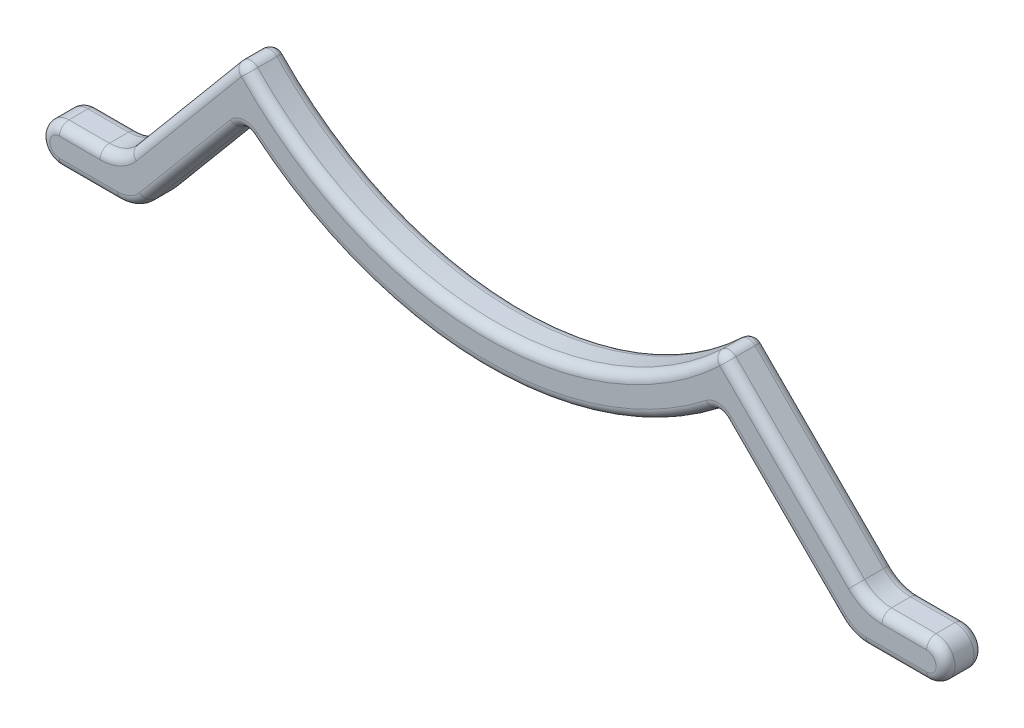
ISO-10303-21;
HEADER;
FILE_DESCRIPTION(('STEP AP214'),'2;1');
FILE_NAME('part.step','',(''),(''),'','','');
FILE_SCHEMA(('AUTOMOTIVE_DESIGN { 1 0 10303 214 1 1 1 1 }'));
ENDSEC;
DATA;
#1=APPLICATION_CONTEXT('core data for automotive mechanical design processes');
#2=APPLICATION_PROTOCOL_DEFINITION('international standard','automotive_design',2000,#1);
#3=PRODUCT_CONTEXT('',#1,'mechanical');
#4=PRODUCT('Part','Part','',(#3));
#5=PRODUCT_RELATED_PRODUCT_CATEGORY('part','',(#4));
#6=PRODUCT_DEFINITION_FORMATION('','',#4);
#7=PRODUCT_DEFINITION_CONTEXT('part definition',#1,'design');
#8=PRODUCT_DEFINITION('design','',#6,#7);
#9=PRODUCT_DEFINITION_SHAPE('','',#8);
#10=(LENGTH_UNIT() NAMED_UNIT(*) SI_UNIT(.MILLI.,.METRE.));
#11=(NAMED_UNIT(*) PLANE_ANGLE_UNIT() SI_UNIT($,.RADIAN.));
#12=(NAMED_UNIT(*) SI_UNIT($,.STERADIAN.) SOLID_ANGLE_UNIT());
#13=UNCERTAINTY_MEASURE_WITH_UNIT(LENGTH_MEASURE(1.E-05),#10,'distance_accuracy_value','');
#14=(GEOMETRIC_REPRESENTATION_CONTEXT(3) GLOBAL_UNCERTAINTY_ASSIGNED_CONTEXT((#13)) GLOBAL_UNIT_ASSIGNED_CONTEXT((#10,
#11,#12)) REPRESENTATION_CONTEXT('',''));
#15=CARTESIAN_POINT('',(0.,0.,0.));
#16=DIRECTION('',(0.,0.,1.));
#17=DIRECTION('',(1.,0.,0.));
#18=AXIS2_PLACEMENT_3D('',#15,#16,#17);
#19=CARTESIAN_POINT('',(-2807.28253814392,-2549.06760476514,125.));
#20=DIRECTION('',(0.,0.,-1.));
#21=DIRECTION('',(-1.,0.,0.));
#22=AXIS2_PLACEMENT_3D('',#19,#20,#21);
#23=CYLINDRICAL_SURFACE('',#22,125.);
#24=DIRECTION('',(0.,0.,-1.));
#25=VECTOR('',#24,1.);
#26=CARTESIAN_POINT('',(-2807.28253814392,-2424.06760476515,125.));
#27=LINE('',#26,#25);
#28=CARTESIAN_POINT('',(-2807.28253814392,-2424.06760476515,62.5));
#29=VERTEX_POINT('',#28);
#30=CARTESIAN_POINT('',(-2807.28253814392,-2424.06760476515,-62.5));
#31=VERTEX_POINT('',#30);
#32=EDGE_CURVE('E520',#29,#31,#27,.T.);
#33=ORIENTED_EDGE('',*,*,#32,.T.);
#34=CARTESIAN_POINT('',(-2807.28253814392,-2549.06760476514,-62.5));
#35=DIRECTION('',(0.,0.,1.));
#36=DIRECTION('',(1.,0.,0.));
#37=AXIS2_PLACEMENT_3D('',#34,#35,#36);
#38=CIRCLE('',#37,125.);
#39=CARTESIAN_POINT('',(-2807.28253814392,-2674.06760476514,-62.5));
#40=VERTEX_POINT('',#39);
#41=EDGE_CURVE('E302',#31,#40,#38,.T.);
#42=ORIENTED_EDGE('',*,*,#41,.T.);
#43=DIRECTION('',(0.,0.,-1.));
#44=VECTOR('',#43,1.);
#45=CARTESIAN_POINT('',(-2807.28253814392,-2674.06760476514,125.));
#46=LINE('',#45,#44);
#47=CARTESIAN_POINT('',(-2807.28253814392,-2674.06760476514,62.5));
#48=VERTEX_POINT('',#47);
#49=EDGE_CURVE('E285',#48,#40,#46,.T.);
#50=ORIENTED_EDGE('',*,*,#49,.F.);
#51=CARTESIAN_POINT('',(-2807.28253814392,-2549.06760476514,62.5));
#52=DIRECTION('',(0.,0.,1.));
#53=DIRECTION('',(1.,0.,0.));
#54=AXIS2_PLACEMENT_3D('',#51,#52,#53);
#55=CIRCLE('',#54,125.);
#56=EDGE_CURVE('E299',#48,#29,#55,.F.);
#57=ORIENTED_EDGE('',*,*,#56,.T.);
#58=EDGE_LOOP('',(#33,#42,#50,#57));
#59=FACE_BOUND('',#58,.T.);
#60=ADVANCED_FACE('F36',(#59),#23,.T.);
#61=CARTESIAN_POINT('',(-2807.28253814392,-2674.06760476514,125.));
#62=DIRECTION('',(0.,1.,0.));
#63=DIRECTION('',(-1.,0.,0.));
#64=AXIS2_PLACEMENT_3D('',#61,#62,#63);
#65=PLANE('',#64);
#66=ORIENTED_EDGE('',*,*,#49,.T.);
#67=DIRECTION('',(1.,0.,0.));
#68=VECTOR('',#67,1.);
#69=CARTESIAN_POINT('',(-2807.28253814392,-2674.06760476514,-62.5));
#70=LINE('',#69,#68);
#71=CARTESIAN_POINT('',(-2424.06760476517,-2674.06760476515,-62.5));
#72=VERTEX_POINT('',#71);
#73=EDGE_CURVE('E292',#40,#72,#70,.T.);
#74=ORIENTED_EDGE('',*,*,#73,.T.);
#75=DIRECTION('',(0.,0.,-1.));
#76=VECTOR('',#75,1.);
#77=CARTESIAN_POINT('',(-2424.06760476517,-2674.06760476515,125.));
#78=LINE('',#77,#76);
#79=CARTESIAN_POINT('',(-2424.06760476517,-2674.06760476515,62.5));
#80=VERTEX_POINT('',#79);
#81=EDGE_CURVE('E287',#80,#72,#78,.T.);
#82=ORIENTED_EDGE('',*,*,#81,.F.);
#83=DIRECTION('',(1.,0.,0.));
#84=VECTOR('',#83,1.);
#85=CARTESIAN_POINT('',(-2807.28253814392,-2674.06760476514,62.5));
#86=LINE('',#85,#84);
#87=EDGE_CURVE('E282',#80,#48,#86,.F.);
#88=ORIENTED_EDGE('',*,*,#87,.T.);
#89=EDGE_LOOP('',(#66,#74,#82,#88));
#90=FACE_BOUND('',#89,.T.);
#91=ADVANCED_FACE('F284',(#90),#65,.F.);
#92=CARTESIAN_POINT('',(-2424.06760476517,-2424.06760476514,125.));
#93=DIRECTION('',(0.,0.,-1.));
#94=DIRECTION('',(-1.,0.,0.));
#95=AXIS2_PLACEMENT_3D('',#92,#93,#94);
#96=CYLINDRICAL_SURFACE('',#95,250.000000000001);
#97=ORIENTED_EDGE('',*,*,#81,.T.);
#98=CARTESIAN_POINT('',(-2424.06760476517,-2424.06760476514,-62.5));
#99=DIRECTION('',(0.,0.,1.));
#100=DIRECTION('',(1.,0.,0.));
#101=AXIS2_PLACEMENT_3D('',#98,#99,#100);
#102=CIRCLE('',#101,250.000000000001);
#103=CARTESIAN_POINT('',(-2232.33694218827,-2584.50249195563,-62.5));
#104=VERTEX_POINT('',#103);
#105=EDGE_CURVE('E360',#72,#104,#102,.T.);
#106=ORIENTED_EDGE('',*,*,#105,.T.);
#107=DIRECTION('',(0.,0.,-1.));
#108=VECTOR('',#107,1.);
#109=CARTESIAN_POINT('',(-2232.33694218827,-2584.50249195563,125.));
#110=LINE('',#109,#108);
#111=CARTESIAN_POINT('',(-2232.33694218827,-2584.50249195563,62.5));
#112=VERTEX_POINT('',#111);
#113=EDGE_CURVE('E614',#112,#104,#110,.T.);
#114=ORIENTED_EDGE('',*,*,#113,.F.);
#115=CARTESIAN_POINT('',(-2424.06760476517,-2424.06760476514,62.5));
#116=DIRECTION('',(0.,0.,1.));
#117=DIRECTION('',(1.,0.,0.));
#118=AXIS2_PLACEMENT_3D('',#115,#116,#117);
#119=CIRCLE('',#118,250.000000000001);
#120=EDGE_CURVE('E358',#112,#80,#119,.F.);
#121=ORIENTED_EDGE('',*,*,#120,.T.);
#122=EDGE_LOOP('',(#97,#106,#114,#121));
#123=FACE_BOUND('',#122,.T.);
#124=ADVANCED_FACE('F618',(#123),#96,.T.);
#125=CARTESIAN_POINT('',(-2232.33694218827,-2584.50249195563,125.));
#126=DIRECTION('',(-0.766922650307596,0.641739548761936,0.));
#127=DIRECTION('',(-0.641739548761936,-0.766922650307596,0.));
#128=AXIS2_PLACEMENT_3D('',#125,#126,#127);
#129=PLANE('',#128);
#130=ORIENTED_EDGE('',*,*,#113,.T.);
#131=DIRECTION('',(0.641739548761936,0.766922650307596,0.));
#132=VECTOR('',#131,1.);
#133=CARTESIAN_POINT('',(-2232.33694218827,-2584.50249195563,-62.5));
#134=LINE('',#133,#132);
#135=CARTESIAN_POINT('',(-1635.38511708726,-1871.10423452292,-62.5));
#136=VERTEX_POINT('',#135);
#137=EDGE_CURVE('E373',#104,#136,#134,.T.);
#138=ORIENTED_EDGE('',*,*,#137,.T.);
#139=DIRECTION('',(0.,0.,-1.));
#140=VECTOR('',#139,1.);
#141=CARTESIAN_POINT('',(-1635.38511708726,-1871.10423452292,125.));
#142=LINE('',#141,#140);
#143=CARTESIAN_POINT('',(-1635.38511708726,-1871.10423452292,62.5));
#144=VERTEX_POINT('',#143);
#145=EDGE_CURVE('E611',#144,#136,#142,.T.);
#146=ORIENTED_EDGE('',*,*,#145,.F.);
#147=DIRECTION('',(0.641739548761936,0.766922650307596,0.));
#148=VECTOR('',#147,1.);
#149=CARTESIAN_POINT('',(-2232.33694218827,-2584.50249195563,62.5));
#150=LINE('',#149,#148);
#151=EDGE_CURVE('E371',#144,#112,#150,.F.);
#152=ORIENTED_EDGE('',*,*,#151,.T.);
#153=EDGE_LOOP('',(#130,#138,#146,#152));
#154=FACE_BOUND('',#153,.T.);
#155=ADVANCED_FACE('F1231',(#154),#129,.F.);
#156=CARTESIAN_POINT('',(-1587.45245144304,-1911.21295632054,125.));
#157=DIRECTION('',(0.,0.,-1.));
#158=DIRECTION('',(-1.,0.,0.));
#159=AXIS2_PLACEMENT_3D('',#156,#157,#158);
#160=CYLINDRICAL_SURFACE('',#159,62.4999999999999);
#161=ORIENTED_EDGE('',*,*,#145,.T.);
#162=CARTESIAN_POINT('',(-1587.45245144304,-1911.21295632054,-62.5));
#163=DIRECTION('',(0.,0.,1.));
#164=DIRECTION('',(1.,0.,0.));
#165=AXIS2_PLACEMENT_3D('',#162,#163,#164);
#166=CIRCLE('',#165,62.4999999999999);
#167=CARTESIAN_POINT('',(-1547.51854996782,-1863.13454627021,-62.5));
#168=VERTEX_POINT('',#167);
#169=EDGE_CURVE('E377',#136,#168,#166,.F.);
#170=ORIENTED_EDGE('',*,*,#169,.T.);
#171=DIRECTION('',(0.,0.,-1.));
#172=VECTOR('',#171,1.);
#173=CARTESIAN_POINT('',(-1547.51854996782,-1863.13454627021,125.));
#174=LINE('',#173,#172);
#175=CARTESIAN_POINT('',(-1547.51854996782,-1863.13454627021,62.5));
#176=VERTEX_POINT('',#175);
#177=EDGE_CURVE('E608',#176,#168,#174,.T.);
#178=ORIENTED_EDGE('',*,*,#177,.F.);
#179=CARTESIAN_POINT('',(-1587.45245144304,-1911.21295632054,62.5));
#180=DIRECTION('',(0.,0.,1.));
#181=DIRECTION('',(1.,0.,0.));
#182=AXIS2_PLACEMENT_3D('',#179,#180,#181);
#183=CIRCLE('',#182,62.4999999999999);
#184=EDGE_CURVE('E375',#176,#144,#183,.T.);
#185=ORIENTED_EDGE('',*,*,#184,.T.);
#186=EDGE_LOOP('',(#161,#170,#178,#185));
#187=FACE_BOUND('',#186,.T.);
#188=ADVANCED_FACE('F1222',(#187),#160,.F.);
#189=CARTESIAN_POINT('',(0.,0.,125.));
#190=DIRECTION('',(0.,0.,-1.));
#191=DIRECTION('',(-1.,0.,0.));
#192=AXIS2_PLACEMENT_3D('',#189,#190,#191);
#193=CYLINDRICAL_SURFACE('',#192,2422.);
#194=ORIENTED_EDGE('',*,*,#177,.T.);
#195=CARTESIAN_POINT('',(0.,0.,-62.5));
#196=DIRECTION('',(0.,0.,1.));
#197=DIRECTION('',(1.,0.,0.));
#198=AXIS2_PLACEMENT_3D('',#195,#196,#197);
#199=CIRCLE('',#198,2422.);
#200=CARTESIAN_POINT('',(1483.5992301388,-1914.42349659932,-62.5));
#201=VERTEX_POINT('',#200);
#202=EDGE_CURVE('E397',#168,#201,#199,.T.);
#203=ORIENTED_EDGE('',*,*,#202,.T.);
#204=DIRECTION('',(0.,0.,-1.));
#205=VECTOR('',#204,1.);
#206=CARTESIAN_POINT('',(1483.5992301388,-1914.42349659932,125.));
#207=LINE('',#206,#205);
#208=CARTESIAN_POINT('',(1483.5992301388,-1914.42349659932,62.5));
#209=VERTEX_POINT('',#208);
#210=EDGE_CURVE('E605',#209,#201,#207,.T.);
#211=ORIENTED_EDGE('',*,*,#210,.F.);
#212=CARTESIAN_POINT('',(0.,0.,62.5));
#213=DIRECTION('',(0.,0.,1.));
#214=DIRECTION('',(1.,0.,0.));
#215=AXIS2_PLACEMENT_3D('',#212,#213,#214);
#216=CIRCLE('',#215,2422.);
#217=EDGE_CURVE('E395',#209,#176,#216,.F.);
#218=ORIENTED_EDGE('',*,*,#217,.T.);
#219=EDGE_LOOP('',(#194,#203,#211,#218));
#220=FACE_BOUND('',#219,.T.);
#221=ADVANCED_FACE('F1213',(#220),#193,.T.);
#222=CARTESIAN_POINT('',(1521.88368591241,-1963.82542415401,125.));
#223=DIRECTION('',(0.,0.,-1.));
#224=DIRECTION('',(-1.,0.,0.));
#225=AXIS2_PLACEMENT_3D('',#222,#223,#224);
#226=CYLINDRICAL_SURFACE('',#225,62.4999999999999);
#227=ORIENTED_EDGE('',*,*,#210,.T.);
#228=CARTESIAN_POINT('',(1521.88368591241,-1963.82542415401,-62.5));
#229=DIRECTION('',(0.,0.,1.));
#230=DIRECTION('',(1.,0.,0.));
#231=AXIS2_PLACEMENT_3D('',#228,#229,#230);
#232=CIRCLE('',#231,62.4999999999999);
#233=CARTESIAN_POINT('',(1566.07785973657,-1919.63125032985,-62.5));
#234=VERTEX_POINT('',#233);
#235=EDGE_CURVE('E401',#201,#234,#232,.F.);
#236=ORIENTED_EDGE('',*,*,#235,.T.);
#237=DIRECTION('',(0.,0.,-1.));
#238=VECTOR('',#237,1.);
#239=CARTESIAN_POINT('',(1566.07785973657,-1919.63125032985,125.));
#240=LINE('',#239,#238);
#241=CARTESIAN_POINT('',(1566.07785973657,-1919.63125032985,62.5));
#242=VERTEX_POINT('',#241);
#243=EDGE_CURVE('E597',#242,#234,#240,.T.);
#244=ORIENTED_EDGE('',*,*,#243,.F.);
#245=CARTESIAN_POINT('',(1521.88368591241,-1963.82542415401,62.5));
#246=DIRECTION('',(0.,0.,1.));
#247=DIRECTION('',(1.,0.,0.));
#248=AXIS2_PLACEMENT_3D('',#245,#246,#247);
#249=CIRCLE('',#248,62.4999999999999);
#250=EDGE_CURVE('E399',#242,#209,#249,.T.);
#251=ORIENTED_EDGE('',*,*,#250,.T.);
#252=EDGE_LOOP('',(#227,#236,#244,#251));
#253=FACE_BOUND('',#252,.T.);
#254=ADVANCED_FACE('F1204',(#253),#226,.F.);
#255=CARTESIAN_POINT('',(2321.8293944,-2675.38278499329,125.));
#256=DIRECTION('',(0.707106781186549,0.707106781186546,0.));
#257=DIRECTION('',(-0.707106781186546,0.707106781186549,0.));
#258=AXIS2_PLACEMENT_3D('',#255,#256,#257);
#259=PLANE('',#258);
#260=ORIENTED_EDGE('',*,*,#243,.T.);
#261=DIRECTION('',(0.707106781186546,-0.707106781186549,0.));
#262=VECTOR('',#261,1.);
#263=CARTESIAN_POINT('',(2321.8293944,-2675.38278499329,-62.5));
#264=LINE('',#263,#262);
#265=CARTESIAN_POINT('',(2321.8293944,-2675.38278499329,-62.5));
#266=VERTEX_POINT('',#265);
#267=EDGE_CURVE('E405',#234,#266,#264,.T.);
#268=ORIENTED_EDGE('',*,*,#267,.T.);
#269=DIRECTION('',(0.,0.,-1.));
#270=VECTOR('',#269,1.);
#271=CARTESIAN_POINT('',(2321.8293944,-2675.38278499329,125.));
#272=LINE('',#271,#270);
#273=CARTESIAN_POINT('',(2321.8293944,-2675.38278499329,62.5));
#274=VERTEX_POINT('',#273);
#275=EDGE_CURVE('E595',#274,#266,#272,.T.);
#276=ORIENTED_EDGE('',*,*,#275,.F.);
#277=DIRECTION('',(0.707106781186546,-0.707106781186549,0.));
#278=VECTOR('',#277,1.);
#279=CARTESIAN_POINT('',(1566.07785973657,-1919.63125032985,62.5));
#280=LINE('',#279,#278);
#281=EDGE_CURVE('E403',#274,#242,#280,.F.);
#282=ORIENTED_EDGE('',*,*,#281,.T.);
#283=EDGE_LOOP('',(#260,#268,#276,#282));
#284=FACE_BOUND('',#283,.T.);
#285=ADVANCED_FACE('F1196',(#284),#259,.F.);
#286=CARTESIAN_POINT('',(2498.60608969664,-2498.60608969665,125.));
#287=DIRECTION('',(0.,0.,-1.));
#288=DIRECTION('',(-1.,0.,0.));
#289=AXIS2_PLACEMENT_3D('',#286,#287,#288);
#290=CYLINDRICAL_SURFACE('',#289,250.);
#291=ORIENTED_EDGE('',*,*,#275,.T.);
#292=CARTESIAN_POINT('',(2498.60608969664,-2498.60608969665,-62.5));
#293=DIRECTION('',(0.,0.,1.));
#294=DIRECTION('',(1.,0.,0.));
#295=AXIS2_PLACEMENT_3D('',#292,#293,#294);
#296=CIRCLE('',#295,250.);
#297=CARTESIAN_POINT('',(2498.60608969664,-2748.60608969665,-62.5));
#298=VERTEX_POINT('',#297);
#299=EDGE_CURVE('E409',#266,#298,#296,.T.);
#300=ORIENTED_EDGE('',*,*,#299,.T.);
#301=DIRECTION('',(0.,0.,-1.));
#302=VECTOR('',#301,1.);
#303=CARTESIAN_POINT('',(2498.60608969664,-2748.60608969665,125.));
#304=LINE('',#303,#302);
#305=CARTESIAN_POINT('',(2498.60608969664,-2748.60608969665,62.5));
#306=VERTEX_POINT('',#305);
#307=EDGE_CURVE('E586',#306,#298,#304,.T.);
#308=ORIENTED_EDGE('',*,*,#307,.F.);
#309=CARTESIAN_POINT('',(2498.60608969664,-2498.60608969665,62.5));
#310=DIRECTION('',(0.,0.,1.));
#311=DIRECTION('',(1.,0.,0.));
#312=AXIS2_PLACEMENT_3D('',#309,#310,#311);
#313=CIRCLE('',#312,250.);
#314=EDGE_CURVE('E407',#306,#274,#313,.F.);
#315=ORIENTED_EDGE('',*,*,#314,.T.);
#316=EDGE_LOOP('',(#291,#300,#308,#315));
#317=FACE_BOUND('',#316,.T.);
#318=ADVANCED_FACE('F592',(#317),#290,.T.);
#319=CARTESIAN_POINT('',(2895.05269910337,-2748.60608969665,125.));
#320=DIRECTION('',(0.,1.,0.));
#321=DIRECTION('',(0.,0.,1.));
#322=AXIS2_PLACEMENT_3D('',#319,#320,#321);
#323=PLANE('',#322);
#324=ORIENTED_EDGE('',*,*,#307,.T.);
#325=DIRECTION('',(1.,0.,0.));
#326=VECTOR('',#325,1.);
#327=CARTESIAN_POINT('',(2895.05269910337,-2748.60608969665,-62.5));
#328=LINE('',#327,#326);
#329=CARTESIAN_POINT('',(2895.05269910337,-2748.60608969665,-62.5));
#330=VERTEX_POINT('',#329);
#331=EDGE_CURVE('E413',#298,#330,#328,.T.);
#332=ORIENTED_EDGE('',*,*,#331,.T.);
#333=DIRECTION('',(0.,0.,-1.));
#334=VECTOR('',#333,1.);
#335=CARTESIAN_POINT('',(2895.05269910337,-2748.60608969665,125.));
#336=LINE('',#335,#334);
#337=CARTESIAN_POINT('',(2895.05269910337,-2748.60608969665,62.5));
#338=VERTEX_POINT('',#337);
#339=EDGE_CURVE('E589',#338,#330,#336,.T.);
#340=ORIENTED_EDGE('',*,*,#339,.F.);
#341=DIRECTION('',(1.,0.,0.));
#342=VECTOR('',#341,1.);
#343=CARTESIAN_POINT('',(2498.60608969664,-2748.60608969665,62.5));
#344=LINE('',#343,#342);
#345=EDGE_CURVE('E411',#338,#306,#344,.F.);
#346=ORIENTED_EDGE('',*,*,#345,.T.);
#347=EDGE_LOOP('',(#324,#332,#340,#346));
#348=FACE_BOUND('',#347,.T.);
#349=ADVANCED_FACE('F585',(#348),#323,.F.);
#350=CARTESIAN_POINT('',(2895.05269910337,-2623.60608969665,125.));
#351=DIRECTION('',(0.,0.,-1.));
#352=DIRECTION('',(-1.,0.,0.));
#353=AXIS2_PLACEMENT_3D('',#350,#351,#352);
#354=CYLINDRICAL_SURFACE('',#353,125.);
#355=ORIENTED_EDGE('',*,*,#339,.T.);
#356=CARTESIAN_POINT('',(2895.05269910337,-2623.60608969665,-62.5));
#357=DIRECTION('',(0.,0.,1.));
#358=DIRECTION('',(1.,0.,0.));
#359=AXIS2_PLACEMENT_3D('',#356,#357,#358);
#360=CIRCLE('',#359,125.);
#361=CARTESIAN_POINT('',(2895.05269910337,-2498.60608969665,-62.5));
#362=VERTEX_POINT('',#361);
#363=EDGE_CURVE('E417',#330,#362,#360,.T.);
#364=ORIENTED_EDGE('',*,*,#363,.T.);
#365=DIRECTION('',(0.,0.,-1.));
#366=VECTOR('',#365,1.);
#367=CARTESIAN_POINT('',(2895.05269910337,-2498.60608969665,125.));
#368=LINE('',#367,#366);
#369=CARTESIAN_POINT('',(2895.05269910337,-2498.60608969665,62.5));
#370=VERTEX_POINT('',#369);
#371=EDGE_CURVE('E599',#370,#362,#368,.T.);
#372=ORIENTED_EDGE('',*,*,#371,.F.);
#373=CARTESIAN_POINT('',(2895.05269910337,-2623.60608969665,62.5));
#374=DIRECTION('',(0.,0.,1.));
#375=DIRECTION('',(1.,0.,0.));
#376=AXIS2_PLACEMENT_3D('',#373,#374,#375);
#377=CIRCLE('',#376,125.);
#378=EDGE_CURVE('E415',#370,#338,#377,.F.);
#379=ORIENTED_EDGE('',*,*,#378,.T.);
#380=EDGE_LOOP('',(#355,#364,#372,#379));
#381=FACE_BOUND('',#380,.T.);
#382=ADVANCED_FACE('F1174',(#381),#354,.T.);
#383=CARTESIAN_POINT('',(2602.15948028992,-2498.60608969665,125.));
#384=DIRECTION('',(0.,-1.,0.));
#385=DIRECTION('',(1.,0.,0.));
#386=AXIS2_PLACEMENT_3D('',#383,#384,#385);
#387=PLANE('',#386);
#388=ORIENTED_EDGE('',*,*,#371,.T.);
#389=DIRECTION('',(-1.,0.,0.));
#390=VECTOR('',#389,1.);
#391=CARTESIAN_POINT('',(2602.15948028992,-2498.60608969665,-62.5));
#392=LINE('',#391,#390);
#393=CARTESIAN_POINT('',(2602.15948028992,-2498.60608969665,-62.5));
#394=VERTEX_POINT('',#393);
#395=EDGE_CURVE('E425',#362,#394,#392,.T.);
#396=ORIENTED_EDGE('',*,*,#395,.T.);
#397=DIRECTION('',(0.,0.,-1.));
#398=VECTOR('',#397,1.);
#399=CARTESIAN_POINT('',(2602.15948028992,-2498.60608969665,125.));
#400=LINE('',#399,#398);
#401=CARTESIAN_POINT('',(2602.15948028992,-2498.60608969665,62.5));
#402=VERTEX_POINT('',#401);
#403=EDGE_CURVE('E692',#402,#394,#400,.T.);
#404=ORIENTED_EDGE('',*,*,#403,.F.);
#405=DIRECTION('',(-1.,0.,0.));
#406=VECTOR('',#405,1.);
#407=CARTESIAN_POINT('',(2895.05269910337,-2498.60608969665,62.5));
#408=LINE('',#407,#406);
#409=EDGE_CURVE('E423',#402,#370,#408,.F.);
#410=ORIENTED_EDGE('',*,*,#409,.T.);
#411=EDGE_LOOP('',(#388,#396,#404,#410));
#412=FACE_BOUND('',#411,.T.);
#413=ADVANCED_FACE('F698',(#412),#387,.F.);
#414=CARTESIAN_POINT('',(2602.15948028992,-2248.60608969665,125.));
#415=DIRECTION('',(0.,0.,-1.));
#416=DIRECTION('',(-1.,0.,0.));
#417=AXIS2_PLACEMENT_3D('',#414,#415,#416);
#418=CYLINDRICAL_SURFACE('',#417,250.);
#419=ORIENTED_EDGE('',*,*,#403,.T.);
#420=CARTESIAN_POINT('',(2602.15948028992,-2248.60608969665,-62.5));
#421=DIRECTION('',(0.,0.,1.));
#422=DIRECTION('',(1.,0.,0.));
#423=AXIS2_PLACEMENT_3D('',#420,#421,#422);
#424=CIRCLE('',#423,250.);
#425=CARTESIAN_POINT('',(2425.38278499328,-2425.38278499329,-62.5));
#426=VERTEX_POINT('',#425);
#427=EDGE_CURVE('E421',#394,#426,#424,.F.);
#428=ORIENTED_EDGE('',*,*,#427,.T.);
#429=DIRECTION('',(0.,0.,-1.));
#430=VECTOR('',#429,1.);
#431=CARTESIAN_POINT('',(2425.38278499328,-2425.38278499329,125.));
#432=LINE('',#431,#430);
#433=CARTESIAN_POINT('',(2425.38278499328,-2425.38278499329,62.5));
#434=VERTEX_POINT('',#433);
#435=EDGE_CURVE('E689',#434,#426,#432,.T.);
#436=ORIENTED_EDGE('',*,*,#435,.F.);
#437=CARTESIAN_POINT('',(2602.15948028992,-2248.60608969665,62.5));
#438=DIRECTION('',(0.,0.,1.));
#439=DIRECTION('',(1.,0.,0.));
#440=AXIS2_PLACEMENT_3D('',#437,#438,#439);
#441=CIRCLE('',#440,250.);
#442=EDGE_CURVE('E419',#434,#402,#441,.T.);
#443=ORIENTED_EDGE('',*,*,#442,.T.);
#444=EDGE_LOOP('',(#419,#428,#436,#443));
#445=FACE_BOUND('',#444,.T.);
#446=ADVANCED_FACE('F720',(#445),#418,.F.);
#447=CARTESIAN_POINT('',(1579.41191587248,-1579.41191587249,125.));
#448=DIRECTION('',(-0.707106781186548,-0.707106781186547,0.));
#449=DIRECTION('',(0.707106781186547,-0.707106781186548,0.));
#450=AXIS2_PLACEMENT_3D('',#447,#448,#449);
#451=PLANE('',#450);
#452=ORIENTED_EDGE('',*,*,#435,.T.);
#453=DIRECTION('',(-0.707106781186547,0.707106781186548,0.));
#454=VECTOR('',#453,1.);
#455=CARTESIAN_POINT('',(1579.41191587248,-1579.41191587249,-62.5));
#456=LINE('',#455,#454);
#457=CARTESIAN_POINT('',(1579.41191587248,-1579.41191587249,-62.5));
#458=VERTEX_POINT('',#457);
#459=EDGE_CURVE('E429',#426,#458,#456,.T.);
#460=ORIENTED_EDGE('',*,*,#459,.T.);
#461=DIRECTION('',(0.,0.,-1.));
#462=VECTOR('',#461,1.);
#463=CARTESIAN_POINT('',(1579.41191587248,-1579.41191587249,125.));
#464=LINE('',#463,#462);
#465=CARTESIAN_POINT('',(1579.41191587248,-1579.41191587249,62.5));
#466=VERTEX_POINT('',#465);
#467=EDGE_CURVE('E686',#466,#458,#464,.T.);
#468=ORIENTED_EDGE('',*,*,#467,.F.);
#469=DIRECTION('',(-0.707106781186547,0.707106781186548,0.));
#470=VECTOR('',#469,1.);
#471=CARTESIAN_POINT('',(2425.38278499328,-2425.38278499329,62.5));
#472=LINE('',#471,#470);
#473=EDGE_CURVE('E427',#466,#434,#472,.F.);
#474=ORIENTED_EDGE('',*,*,#473,.T.);
#475=EDGE_LOOP('',(#452,#460,#468,#474));
#476=FACE_BOUND('',#475,.T.);
#477=ADVANCED_FACE('F723',(#476),#451,.F.);
#478=CARTESIAN_POINT('',(1535.21774204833,-1623.60608969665,125.));
#479=DIRECTION('',(0.,0.,-1.));
#480=DIRECTION('',(-1.,0.,0.));
#481=AXIS2_PLACEMENT_3D('',#478,#479,#480);
#482=CYLINDRICAL_SURFACE('',#481,62.4999999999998);
#483=ORIENTED_EDGE('',*,*,#467,.T.);
#484=CARTESIAN_POINT('',(1535.21774204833,-1623.60608969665,-62.5));
#485=DIRECTION('',(0.,0.,-1.));
#486=DIRECTION('',(-1.,0.,0.));
#487=AXIS2_PLACEMENT_3D('',#484,#485,#486);
#488=CIRCLE('',#487,62.4999999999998);
#489=CARTESIAN_POINT('',(1492.27699070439,-1578.19307532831,-62.5));
#490=VERTEX_POINT('',#489);
#491=EDGE_CURVE('E393',#458,#490,#488,.F.);
#492=ORIENTED_EDGE('',*,*,#491,.T.);
#493=DIRECTION('',(0.,0.,-1.));
#494=VECTOR('',#493,1.);
#495=CARTESIAN_POINT('',(1492.27699070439,-1578.19307532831,125.));
#496=LINE('',#495,#494);
#497=CARTESIAN_POINT('',(1492.27699070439,-1578.19307532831,62.5));
#498=VERTEX_POINT('',#497);
#499=EDGE_CURVE('E678',#498,#490,#496,.T.);
#500=ORIENTED_EDGE('',*,*,#499,.F.);
#501=CARTESIAN_POINT('',(1535.21774204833,-1623.60608969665,62.5));
#502=DIRECTION('',(0.,0.,-1.));
#503=DIRECTION('',(-1.,0.,0.));
#504=AXIS2_PLACEMENT_3D('',#501,#502,#503);
#505=CIRCLE('',#504,62.4999999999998);
#506=EDGE_CURVE('E391',#498,#466,#505,.T.);
#507=ORIENTED_EDGE('',*,*,#506,.T.);
#508=EDGE_LOOP('',(#483,#492,#500,#507));
#509=FACE_BOUND('',#508,.T.);
#510=ADVANCED_FACE('F1143',(#509),#482,.T.);
#511=CARTESIAN_POINT('',(0.,0.,125.));
#512=DIRECTION('',(0.,0.,-1.));
#513=DIRECTION('',(-1.,0.,0.));
#514=AXIS2_PLACEMENT_3D('',#511,#512,#513);
#515=CYLINDRICAL_SURFACE('',#514,2172.);
#516=ORIENTED_EDGE('',*,*,#499,.T.);
#517=CARTESIAN_POINT('',(0.,0.,-62.5));
#518=DIRECTION('',(0.,0.,1.));
#519=DIRECTION('',(1.,0.,0.));
#520=AXIS2_PLACEMENT_3D('',#517,#518,#519);
#521=CIRCLE('',#520,2172.);
#522=CARTESIAN_POINT('',(-1565.35384481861,-1505.73946634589,-62.5));
#523=VERTEX_POINT('',#522);
#524=EDGE_CURVE('E389',#490,#523,#521,.F.);
#525=ORIENTED_EDGE('',*,*,#524,.T.);
#526=DIRECTION('',(0.,0.,-1.));
#527=VECTOR('',#526,1.);
#528=CARTESIAN_POINT('',(-1565.35384481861,-1505.73946634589,125.));
#529=LINE('',#528,#527);
#530=CARTESIAN_POINT('',(-1565.35384481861,-1505.73946634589,62.5));
#531=VERTEX_POINT('',#530);
#532=EDGE_CURVE('E670',#531,#523,#529,.T.);
#533=ORIENTED_EDGE('',*,*,#532,.F.);
#534=CARTESIAN_POINT('',(0.,0.,62.5));
#535=DIRECTION('',(0.,0.,1.));
#536=DIRECTION('',(1.,0.,0.));
#537=AXIS2_PLACEMENT_3D('',#534,#535,#536);
#538=CIRCLE('',#537,2172.);
#539=EDGE_CURVE('E387',#531,#498,#538,.T.);
#540=ORIENTED_EDGE('',*,*,#539,.T.);
#541=EDGE_LOOP('',(#516,#525,#533,#540));
#542=FACE_BOUND('',#541,.T.);
#543=ADVANCED_FACE('F1135',(#542),#515,.F.);
#544=CARTESIAN_POINT('',(-1610.39740619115,-1549.06760476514,125.));
#545=DIRECTION('',(0.,0.,-1.));
#546=DIRECTION('',(-1.,0.,0.));
#547=AXIS2_PLACEMENT_3D('',#544,#545,#546);
#548=CYLINDRICAL_SURFACE('',#547,62.5);
#549=ORIENTED_EDGE('',*,*,#532,.T.);
#550=CARTESIAN_POINT('',(-1610.39740619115,-1549.06760476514,-62.5));
#551=DIRECTION('',(0.,0.,-1.));
#552=DIRECTION('',(-1.,0.,0.));
#553=AXIS2_PLACEMENT_3D('',#550,#551,#552);
#554=CIRCLE('',#553,62.5);
#555=CARTESIAN_POINT('',(-1658.33007183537,-1508.95888296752,-62.5));
#556=VERTEX_POINT('',#555);
#557=EDGE_CURVE('E385',#523,#556,#554,.F.);
#558=ORIENTED_EDGE('',*,*,#557,.T.);
#559=DIRECTION('',(0.,0.,-1.));
#560=VECTOR('',#559,1.);
#561=CARTESIAN_POINT('',(-1658.33007183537,-1508.95888296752,125.));
#562=LINE('',#561,#560);
#563=CARTESIAN_POINT('',(-1658.33007183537,-1508.95888296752,62.5));
#564=VERTEX_POINT('',#563);
#565=EDGE_CURVE('E667',#564,#556,#562,.T.);
#566=ORIENTED_EDGE('',*,*,#565,.F.);
#567=CARTESIAN_POINT('',(-1610.39740619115,-1549.06760476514,62.5));
#568=DIRECTION('',(0.,0.,-1.));
#569=DIRECTION('',(-1.,0.,0.));
#570=AXIS2_PLACEMENT_3D('',#567,#568,#569);
#571=CIRCLE('',#570,62.5);
#572=EDGE_CURVE('E383',#564,#531,#571,.T.);
#573=ORIENTED_EDGE('',*,*,#572,.T.);
#574=EDGE_LOOP('',(#549,#558,#566,#573));
#575=FACE_BOUND('',#574,.T.);
#576=ADVANCED_FACE('F666',(#575),#548,.T.);
#577=CARTESIAN_POINT('',(-1658.33007183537,-1508.95888296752,125.));
#578=DIRECTION('',(0.766922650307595,-0.641739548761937,0.));
#579=DIRECTION('',(0.641739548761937,0.766922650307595,0.));
#580=AXIS2_PLACEMENT_3D('',#577,#578,#579);
#581=PLANE('',#580);
#582=ORIENTED_EDGE('',*,*,#565,.T.);
#583=DIRECTION('',(-0.641739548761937,-0.766922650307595,0.));
#584=VECTOR('',#583,1.);
#585=CARTESIAN_POINT('',(-1658.33007183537,-1508.95888296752,-62.5));
#586=LINE('',#585,#584);
#587=CARTESIAN_POINT('',(-2349.12200880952,-2334.50249195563,-62.5));
#588=VERTEX_POINT('',#587);
#589=EDGE_CURVE('E381',#556,#588,#586,.T.);
#590=ORIENTED_EDGE('',*,*,#589,.T.);
#591=DIRECTION('',(0.,0.,-1.));
#592=VECTOR('',#591,1.);
#593=CARTESIAN_POINT('',(-2349.12200880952,-2334.50249195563,125.));
#594=LINE('',#593,#592);
#595=CARTESIAN_POINT('',(-2349.12200880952,-2334.50249195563,62.5));
#596=VERTEX_POINT('',#595);
#597=EDGE_CURVE('E676',#596,#588,#594,.T.);
#598=ORIENTED_EDGE('',*,*,#597,.F.);
#599=DIRECTION('',(-0.641739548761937,-0.766922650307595,0.));
#600=VECTOR('',#599,1.);
#601=CARTESIAN_POINT('',(-1658.33007183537,-1508.95888296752,62.5));
#602=LINE('',#601,#600);
#603=EDGE_CURVE('E379',#596,#564,#602,.F.);
#604=ORIENTED_EDGE('',*,*,#603,.T.);
#605=EDGE_LOOP('',(#582,#590,#598,#604));
#606=FACE_BOUND('',#605,.T.);
#607=ADVANCED_FACE('F672',(#606),#581,.F.);
#608=CARTESIAN_POINT('',(-2540.85267138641,-2174.06760476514,125.));
#609=DIRECTION('',(0.,0.,-1.));
#610=DIRECTION('',(-1.,0.,0.));
#611=AXIS2_PLACEMENT_3D('',#608,#609,#610);
#612=CYLINDRICAL_SURFACE('',#611,250.);
#613=ORIENTED_EDGE('',*,*,#597,.T.);
#614=CARTESIAN_POINT('',(-2540.85267138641,-2174.06760476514,-62.5));
#615=DIRECTION('',(0.,0.,1.));
#616=DIRECTION('',(1.,0.,0.));
#617=AXIS2_PLACEMENT_3D('',#614,#615,#616);
#618=CIRCLE('',#617,250.);
#619=CARTESIAN_POINT('',(-2540.85267138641,-2424.06760476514,-62.5));
#620=VERTEX_POINT('',#619);
#621=EDGE_CURVE('E364',#588,#620,#618,.F.);
#622=ORIENTED_EDGE('',*,*,#621,.T.);
#623=DIRECTION('',(0.,0.,-1.));
#624=VECTOR('',#623,1.);
#625=CARTESIAN_POINT('',(-2540.85267138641,-2424.06760476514,125.));
#626=LINE('',#625,#624);
#627=CARTESIAN_POINT('',(-2540.85267138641,-2424.06760476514,62.5));
#628=VERTEX_POINT('',#627);
#629=EDGE_CURVE('E680',#628,#620,#626,.T.);
#630=ORIENTED_EDGE('',*,*,#629,.F.);
#631=CARTESIAN_POINT('',(-2540.85267138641,-2174.06760476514,62.5));
#632=DIRECTION('',(0.,0.,1.));
#633=DIRECTION('',(1.,0.,0.));
#634=AXIS2_PLACEMENT_3D('',#631,#632,#633);
#635=CIRCLE('',#634,250.);
#636=EDGE_CURVE('E362',#628,#596,#635,.T.);
#637=ORIENTED_EDGE('',*,*,#636,.T.);
#638=EDGE_LOOP('',(#613,#622,#630,#637));
#639=FACE_BOUND('',#638,.T.);
#640=ADVANCED_FACE('F1111',(#639),#612,.F.);
#641=CARTESIAN_POINT('',(-2540.85267138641,-2424.06760476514,125.));
#642=DIRECTION('',(0.,-1.,0.));
#643=DIRECTION('',(1.,0.,0.));
#644=AXIS2_PLACEMENT_3D('',#641,#642,#643);
#645=PLANE('',#644);
#646=ORIENTED_EDGE('',*,*,#629,.T.);
#647=DIRECTION('',(-1.,0.,0.));
#648=VECTOR('',#647,1.);
#649=CARTESIAN_POINT('',(-2540.85267138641,-2424.06760476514,-62.5));
#650=LINE('',#649,#648);
#651=EDGE_CURVE('E369',#620,#31,#650,.T.);
#652=ORIENTED_EDGE('',*,*,#651,.T.);
#653=ORIENTED_EDGE('',*,*,#32,.F.);
#654=DIRECTION('',(-1.,0.,0.));
#655=VECTOR('',#654,1.);
#656=CARTESIAN_POINT('',(-2540.85267138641,-2424.06760476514,62.5));
#657=LINE('',#656,#655);
#658=EDGE_CURVE('E366',#29,#628,#657,.F.);
#659=ORIENTED_EDGE('',*,*,#658,.T.);
#660=EDGE_LOOP('',(#646,#652,#653,#659));
#661=FACE_BOUND('',#660,.T.);
#662=ADVANCED_FACE('F1103',(#661),#645,.F.);
#663=CARTESIAN_POINT('',(-2807.28253814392,-2549.06760476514,125.));
#664=DIRECTION('',(0.,0.,1.));
#665=DIRECTION('',(1.,0.,0.));
#666=AXIS2_PLACEMENT_3D('',#663,#664,#665);
#667=PLANE('',#666);
#668=CARTESIAN_POINT('',(-2540.85267138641,-2174.06760476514,125.));
#669=DIRECTION('',(0.,0.,1.));
#670=DIRECTION('',(1.,0.,0.));
#671=AXIS2_PLACEMENT_3D('',#668,#669,#670);
#672=CIRCLE('',#671,312.5);
#673=CARTESIAN_POINT('',(-2301.18934316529,-2374.61121375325,125.));
#674=VERTEX_POINT('',#673);
#675=CARTESIAN_POINT('',(-2540.85267138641,-2486.56760476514,125.));
#676=VERTEX_POINT('',#675);
#677=EDGE_CURVE('E45',#674,#676,#672,.F.);
#678=ORIENTED_EDGE('',*,*,#677,.T.);
#679=DIRECTION('',(-1.,0.,0.));
#680=VECTOR('',#679,1.);
#681=CARTESIAN_POINT('',(-2807.28253814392,-2486.56760476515,125.));
#682=LINE('',#681,#680);
#683=CARTESIAN_POINT('',(-2807.28253814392,-2486.56760476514,125.));
#684=VERTEX_POINT('',#683);
#685=EDGE_CURVE('E11',#676,#684,#682,.T.);
#686=ORIENTED_EDGE('',*,*,#685,.T.);
#687=CARTESIAN_POINT('',(-2807.28253814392,-2549.06760476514,125.));
#688=DIRECTION('',(0.,0.,1.));
#689=DIRECTION('',(1.,0.,0.));
#690=AXIS2_PLACEMENT_3D('',#687,#688,#689);
#691=CIRCLE('',#690,62.4999999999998);
#692=CARTESIAN_POINT('',(-2807.28253814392,-2611.56760476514,125.));
#693=VERTEX_POINT('',#692);
#694=EDGE_CURVE('E431',#684,#693,#691,.T.);
#695=ORIENTED_EDGE('',*,*,#694,.T.);
#696=DIRECTION('',(1.,0.,0.));
#697=VECTOR('',#696,1.);
#698=CARTESIAN_POINT('',(-2424.06760476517,-2611.56760476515,125.));
#699=LINE('',#698,#697);
#700=CARTESIAN_POINT('',(-2424.06760476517,-2611.56760476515,125.));
#701=VERTEX_POINT('',#700);
#702=EDGE_CURVE('E308',#693,#701,#699,.T.);
#703=ORIENTED_EDGE('',*,*,#702,.T.);
#704=CARTESIAN_POINT('',(-2424.06760476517,-2424.06760476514,125.));
#705=DIRECTION('',(0.,0.,1.));
#706=DIRECTION('',(1.,0.,0.));
#707=AXIS2_PLACEMENT_3D('',#704,#705,#706);
#708=CIRCLE('',#707,187.500000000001);
#709=CARTESIAN_POINT('',(-2280.26960783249,-2544.39377015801,125.));
#710=VERTEX_POINT('',#709);
#711=EDGE_CURVE('E434',#701,#710,#708,.T.);
#712=ORIENTED_EDGE('',*,*,#711,.T.);
#713=DIRECTION('',(0.641739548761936,0.766922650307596,0.));
#714=VECTOR('',#713,1.);
#715=CARTESIAN_POINT('',(-1683.31778273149,-1830.9955127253,125.));
#716=LINE('',#715,#714);
#717=CARTESIAN_POINT('',(-1683.31778273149,-1830.9955127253,125.));
#718=VERTEX_POINT('',#717);
#719=EDGE_CURVE('E436',#710,#718,#716,.T.);
#720=ORIENTED_EDGE('',*,*,#719,.T.);
#721=CARTESIAN_POINT('',(-1587.45245144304,-1911.21295632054,125.));
#722=DIRECTION('',(0.,0.,1.));
#723=DIRECTION('',(1.,0.,0.));
#724=AXIS2_PLACEMENT_3D('',#721,#722,#723);
#725=CIRCLE('',#724,125.);
#726=CARTESIAN_POINT('',(-1507.58464849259,-1815.05613621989,125.));
#727=VERTEX_POINT('',#726);
#728=EDGE_CURVE('E438',#718,#727,#725,.F.);
#729=ORIENTED_EDGE('',*,*,#728,.T.);
#730=CARTESIAN_POINT('',(0.,0.,125.));
#731=DIRECTION('',(0.,0.,1.));
#732=DIRECTION('',(1.,0.,0.));
#733=AXIS2_PLACEMENT_3D('',#730,#731,#732);
#734=CIRCLE('',#733,2359.5);
#735=CARTESIAN_POINT('',(1445.3147743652,-1865.02156904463,125.));
#736=VERTEX_POINT('',#735);
#737=EDGE_CURVE('E440',#727,#736,#734,.T.);
#738=ORIENTED_EDGE('',*,*,#737,.T.);
#739=CARTESIAN_POINT('',(1521.88368591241,-1963.82542415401,125.));
#740=DIRECTION('',(0.,0.,1.));
#741=DIRECTION('',(1.,0.,0.));
#742=AXIS2_PLACEMENT_3D('',#739,#740,#741);
#743=CIRCLE('',#742,125.);
#744=CARTESIAN_POINT('',(1610.27203356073,-1875.43707650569,125.));
#745=VERTEX_POINT('',#744);
#746=EDGE_CURVE('E442',#736,#745,#743,.F.);
#747=ORIENTED_EDGE('',*,*,#746,.T.);
#748=DIRECTION('',(0.707106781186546,-0.707106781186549,0.));
#749=VECTOR('',#748,1.);
#750=CARTESIAN_POINT('',(2366.02356822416,-2631.18861116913,125.));
#751=LINE('',#750,#749);
#752=CARTESIAN_POINT('',(2366.02356822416,-2631.18861116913,125.));
#753=VERTEX_POINT('',#752);
#754=EDGE_CURVE('E444',#745,#753,#751,.T.);
#755=ORIENTED_EDGE('',*,*,#754,.T.);
#756=CARTESIAN_POINT('',(2498.60608969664,-2498.60608969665,125.));
#757=DIRECTION('',(0.,0.,1.));
#758=DIRECTION('',(1.,0.,0.));
#759=AXIS2_PLACEMENT_3D('',#756,#757,#758);
#760=CIRCLE('',#759,187.5);
#761=CARTESIAN_POINT('',(2498.60608969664,-2686.10608969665,125.));
#762=VERTEX_POINT('',#761);
#763=EDGE_CURVE('E446',#753,#762,#760,.T.);
#764=ORIENTED_EDGE('',*,*,#763,.T.);
#765=DIRECTION('',(1.,0.,0.));
#766=VECTOR('',#765,1.);
#767=CARTESIAN_POINT('',(2895.05269910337,-2686.10608969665,125.));
#768=LINE('',#767,#766);
#769=CARTESIAN_POINT('',(2895.05269910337,-2686.10608969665,125.));
#770=VERTEX_POINT('',#769);
#771=EDGE_CURVE('E448',#762,#770,#768,.T.);
#772=ORIENTED_EDGE('',*,*,#771,.T.);
#773=CARTESIAN_POINT('',(2895.05269910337,-2623.60608969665,125.));
#774=DIRECTION('',(0.,0.,1.));
#775=DIRECTION('',(1.,0.,0.));
#776=AXIS2_PLACEMENT_3D('',#773,#774,#775);
#777=CIRCLE('',#776,62.4999999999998);
#778=CARTESIAN_POINT('',(2895.05269910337,-2561.10608969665,125.));
#779=VERTEX_POINT('',#778);
#780=EDGE_CURVE('E450',#770,#779,#777,.T.);
#781=ORIENTED_EDGE('',*,*,#780,.T.);
#782=DIRECTION('',(-1.,0.,0.));
#783=VECTOR('',#782,1.);
#784=CARTESIAN_POINT('',(2602.15948028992,-2561.10608969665,125.));
#785=LINE('',#784,#783);
#786=CARTESIAN_POINT('',(2602.15948028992,-2561.10608969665,125.));
#787=VERTEX_POINT('',#786);
#788=EDGE_CURVE('E452',#779,#787,#785,.T.);
#789=ORIENTED_EDGE('',*,*,#788,.T.);
#790=CARTESIAN_POINT('',(2602.15948028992,-2248.60608969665,125.));
#791=DIRECTION('',(0.,0.,1.));
#792=DIRECTION('',(1.,0.,0.));
#793=AXIS2_PLACEMENT_3D('',#790,#791,#792);
#794=CIRCLE('',#793,312.5);
#795=CARTESIAN_POINT('',(2381.18861116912,-2469.57695881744,125.));
#796=VERTEX_POINT('',#795);
#797=EDGE_CURVE('E454',#787,#796,#794,.F.);
#798=ORIENTED_EDGE('',*,*,#797,.T.);
#799=DIRECTION('',(-0.707106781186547,0.707106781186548,0.));
#800=VECTOR('',#799,1.);
#801=CARTESIAN_POINT('',(1535.21774204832,-1623.60608969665,125.));
#802=LINE('',#801,#800);
#803=CARTESIAN_POINT('',(1535.21774204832,-1623.60608969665,125.));
#804=VERTEX_POINT('',#803);
#805=EDGE_CURVE('E456',#796,#804,#802,.T.);
#806=ORIENTED_EDGE('',*,*,#805,.T.);
#807=CARTESIAN_POINT('',(0.,0.,125.));
#808=DIRECTION('',(0.,0.,1.));
#809=DIRECTION('',(1.,0.,0.));
#810=AXIS2_PLACEMENT_3D('',#807,#808,#809);
#811=CIRCLE('',#810,2234.5);
#812=CARTESIAN_POINT('',(-1610.39740619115,-1549.06760476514,125.));
#813=VERTEX_POINT('',#812);
#814=EDGE_CURVE('E458',#804,#813,#811,.F.);
#815=ORIENTED_EDGE('',*,*,#814,.T.);
#816=DIRECTION('',(-0.641739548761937,-0.766922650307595,0.));
#817=VECTOR('',#816,1.);
#818=CARTESIAN_POINT('',(-2301.18934316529,-2374.61121375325,125.));
#819=LINE('',#818,#817);
#820=EDGE_CURVE('E56',#813,#674,#819,.T.);
#821=ORIENTED_EDGE('',*,*,#820,.T.);
#822=EDGE_LOOP('',(#678,#686,#695,#703,#712,#720,#729,#738,#747,#755,#764,#772,#781,#789,#798,
#806,#815,#821));
#823=FACE_BOUND('',#822,.T.);
#824=ADVANCED_FACE('F741',(#823),#667,.T.);
#825=CARTESIAN_POINT('',(-2807.28253814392,-2549.06760476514,-125.));
#826=DIRECTION('',(0.,0.,1.));
#827=DIRECTION('',(1.,0.,0.));
#828=AXIS2_PLACEMENT_3D('',#825,#826,#827);
#829=PLANE('',#828);
#830=DIRECTION('',(1.,0.,0.));
#831=VECTOR('',#830,1.);
#832=CARTESIAN_POINT('',(-2807.28253814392,-2611.56760476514,-125.));
#833=LINE('',#832,#831);
#834=CARTESIAN_POINT('',(-2424.06760476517,-2611.56760476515,-125.));
#835=VERTEX_POINT('',#834);
#836=CARTESIAN_POINT('',(-2807.28253814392,-2611.56760476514,-125.));
#837=VERTEX_POINT('',#836);
#838=EDGE_CURVE('E353',#835,#837,#833,.F.);
#839=ORIENTED_EDGE('',*,*,#838,.T.);
#840=CARTESIAN_POINT('',(-2807.28253814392,-2549.06760476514,-125.));
#841=DIRECTION('',(0.,0.,1.));
#842=DIRECTION('',(1.,0.,0.));
#843=AXIS2_PLACEMENT_3D('',#840,#841,#842);
#844=CIRCLE('',#843,62.4999999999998);
#845=CARTESIAN_POINT('',(-2807.28253814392,-2486.56760476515,-125.));
#846=VERTEX_POINT('',#845);
#847=EDGE_CURVE('E293',#837,#846,#844,.F.);
#848=ORIENTED_EDGE('',*,*,#847,.T.);
#849=DIRECTION('',(-1.,0.,0.));
#850=VECTOR('',#849,1.);
#851=CARTESIAN_POINT('',(-2807.28253814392,-2486.56760476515,-125.));
#852=LINE('',#851,#850);
#853=CARTESIAN_POINT('',(-2540.85267138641,-2486.56760476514,-125.));
#854=VERTEX_POINT('',#853);
#855=EDGE_CURVE('E349',#846,#854,#852,.F.);
#856=ORIENTED_EDGE('',*,*,#855,.T.);
#857=CARTESIAN_POINT('',(-2540.85267138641,-2174.06760476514,-125.));
#858=DIRECTION('',(0.,0.,1.));
#859=DIRECTION('',(1.,0.,0.));
#860=AXIS2_PLACEMENT_3D('',#857,#858,#859);
#861=CIRCLE('',#860,312.5);
#862=CARTESIAN_POINT('',(-2301.18934316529,-2374.61121375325,-125.));
#863=VERTEX_POINT('',#862);
#864=EDGE_CURVE('E329',#854,#863,#861,.T.);
#865=ORIENTED_EDGE('',*,*,#864,.T.);
#866=DIRECTION('',(-0.641739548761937,-0.766922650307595,0.));
#867=VECTOR('',#866,1.);
#868=CARTESIAN_POINT('',(-2595.47478485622,-2726.30244319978,-125.));
#869=LINE('',#868,#867);
#870=CARTESIAN_POINT('',(-1610.39740619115,-1549.06760476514,-125.));
#871=VERTEX_POINT('',#870);
#872=EDGE_CURVE('E327',#863,#871,#869,.F.);
#873=ORIENTED_EDGE('',*,*,#872,.T.);
#874=CARTESIAN_POINT('',(0.,0.,-125.));
#875=DIRECTION('',(0.,0.,1.));
#876=DIRECTION('',(1.,0.,0.));
#877=AXIS2_PLACEMENT_3D('',#874,#875,#876);
#878=CIRCLE('',#877,2234.5);
#879=CARTESIAN_POINT('',(1535.21774204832,-1623.60608969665,-125.));
#880=VERTEX_POINT('',#879);
#881=EDGE_CURVE('E325',#871,#880,#878,.T.);
#882=ORIENTED_EDGE('',*,*,#881,.T.);
#883=DIRECTION('',(-0.707106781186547,0.707106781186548,0.));
#884=VECTOR('',#883,1.);
#885=CARTESIAN_POINT('',(-173.301640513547,84.9132928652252,-125.));
#886=LINE('',#885,#884);
#887=CARTESIAN_POINT('',(2381.18861116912,-2469.57695881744,-125.));
#888=VERTEX_POINT('',#887);
#889=EDGE_CURVE('E318',#880,#888,#886,.F.);
#890=ORIENTED_EDGE('',*,*,#889,.T.);
#891=CARTESIAN_POINT('',(2602.15948028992,-2248.60608969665,-125.));
#892=DIRECTION('',(0.,0.,1.));
#893=DIRECTION('',(1.,0.,0.));
#894=AXIS2_PLACEMENT_3D('',#891,#892,#893);
#895=CIRCLE('',#894,312.5);
#896=CARTESIAN_POINT('',(2602.15948028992,-2561.10608969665,-125.));
#897=VERTEX_POINT('',#896);
#898=EDGE_CURVE('E323',#888,#897,#895,.T.);
#899=ORIENTED_EDGE('',*,*,#898,.T.);
#900=DIRECTION('',(-1.,0.,0.));
#901=VECTOR('',#900,1.);
#902=CARTESIAN_POINT('',(-2807.28253814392,-2561.10608969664,-125.));
#903=LINE('',#902,#901);
#904=CARTESIAN_POINT('',(2895.05269910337,-2561.10608969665,-125.));
#905=VERTEX_POINT('',#904);
#906=EDGE_CURVE('E331',#897,#905,#903,.F.);
#907=ORIENTED_EDGE('',*,*,#906,.T.);
#908=CARTESIAN_POINT('',(2895.05269910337,-2623.60608969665,-125.));
#909=DIRECTION('',(0.,0.,1.));
#910=DIRECTION('',(1.,0.,0.));
#911=AXIS2_PLACEMENT_3D('',#908,#909,#910);
#912=CIRCLE('',#911,62.4999999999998);
#913=CARTESIAN_POINT('',(2895.05269910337,-2686.10608969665,-125.));
#914=VERTEX_POINT('',#913);
#915=EDGE_CURVE('E333',#905,#914,#912,.F.);
#916=ORIENTED_EDGE('',*,*,#915,.T.);
#917=DIRECTION('',(1.,0.,0.));
#918=VECTOR('',#917,1.);
#919=CARTESIAN_POINT('',(-2807.28253814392,-2686.10608969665,-125.));
#920=LINE('',#919,#918);
#921=CARTESIAN_POINT('',(2498.60608969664,-2686.10608969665,-125.));
#922=VERTEX_POINT('',#921);
#923=EDGE_CURVE('E335',#914,#922,#920,.F.);
#924=ORIENTED_EDGE('',*,*,#923,.T.);
#925=CARTESIAN_POINT('',(2498.60608969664,-2498.60608969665,-125.));
#926=DIRECTION('',(0.,0.,1.));
#927=DIRECTION('',(1.,0.,0.));
#928=AXIS2_PLACEMENT_3D('',#925,#926,#927);
#929=CIRCLE('',#928,187.5);
#930=CARTESIAN_POINT('',(2366.02356822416,-2631.18861116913,-125.));
#931=VERTEX_POINT('',#930);
#932=EDGE_CURVE('E337',#922,#931,#929,.F.);
#933=ORIENTED_EDGE('',*,*,#932,.T.);
#934=DIRECTION('',(0.707106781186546,-0.707106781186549,0.));
#935=VECTOR('',#934,1.);
#936=CARTESIAN_POINT('',(-261.689988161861,-3.47505478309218,-125.));
#937=LINE('',#936,#935);
#938=CARTESIAN_POINT('',(1610.27203356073,-1875.43707650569,-125.));
#939=VERTEX_POINT('',#938);
#940=EDGE_CURVE('E339',#931,#939,#937,.F.);
#941=ORIENTED_EDGE('',*,*,#940,.T.);
#942=CARTESIAN_POINT('',(1521.88368591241,-1963.82542415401,-125.));
#943=DIRECTION('',(0.,0.,1.));
#944=DIRECTION('',(1.,0.,0.));
#945=AXIS2_PLACEMENT_3D('',#942,#943,#944);
#946=CIRCLE('',#945,125.);
#947=CARTESIAN_POINT('',(1445.3147743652,-1865.02156904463,-125.));
#948=VERTEX_POINT('',#947);
#949=EDGE_CURVE('E341',#939,#948,#946,.T.);
#950=ORIENTED_EDGE('',*,*,#949,.T.);
#951=CARTESIAN_POINT('',(0.,0.,-125.));
#952=DIRECTION('',(0.,0.,1.));
#953=DIRECTION('',(1.,0.,0.));
#954=AXIS2_PLACEMENT_3D('',#951,#952,#953);
#955=CIRCLE('',#954,2359.5);
#956=CARTESIAN_POINT('',(-1507.58464849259,-1815.05613621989,-125.));
#957=VERTEX_POINT('',#956);
#958=EDGE_CURVE('E343',#948,#957,#955,.F.);
#959=ORIENTED_EDGE('',*,*,#958,.T.);
#960=CARTESIAN_POINT('',(-1587.45245144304,-1911.21295632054,-125.));
#961=DIRECTION('',(0.,0.,1.));
#962=DIRECTION('',(1.,0.,0.));
#963=AXIS2_PLACEMENT_3D('',#960,#961,#962);
#964=CIRCLE('',#963,125.);
#965=CARTESIAN_POINT('',(-1683.31778273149,-1830.9955127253,-125.));
#966=VERTEX_POINT('',#965);
#967=EDGE_CURVE('E345',#957,#966,#964,.T.);
#968=ORIENTED_EDGE('',*,*,#967,.T.);
#969=DIRECTION('',(0.641739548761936,0.766922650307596,0.));
#970=VECTOR('',#969,1.);
#971=CARTESIAN_POINT('',(-2499.60945356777,-2806.51988679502,-125.));
#972=LINE('',#971,#970);
#973=CARTESIAN_POINT('',(-2280.26960783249,-2544.39377015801,-125.));
#974=VERTEX_POINT('',#973);
#975=EDGE_CURVE('E347',#966,#974,#972,.F.);
#976=ORIENTED_EDGE('',*,*,#975,.T.);
#977=CARTESIAN_POINT('',(-2424.06760476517,-2424.06760476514,-125.));
#978=DIRECTION('',(0.,0.,1.));
#979=DIRECTION('',(1.,0.,0.));
#980=AXIS2_PLACEMENT_3D('',#977,#978,#979);
#981=CIRCLE('',#980,187.500000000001);
#982=EDGE_CURVE('E351',#974,#835,#981,.F.);
#983=ORIENTED_EDGE('',*,*,#982,.T.);
#984=EDGE_LOOP('',(#839,#848,#856,#865,#873,#882,#890,#899,#907,#916,#924,#933,#941,#950,#959,
#968,#976,#983));
#985=FACE_BOUND('',#984,.T.);
#986=ADVANCED_FACE('F633',(#985),#829,.F.);
#987=CARTESIAN_POINT('',(2895.05269910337,-2623.60608969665,-62.5));
#988=DIRECTION('',(0.,0.,1.));
#989=DIRECTION('',(1.,0.,0.));
#990=AXIS2_PLACEMENT_3D('',#987,#988,#989);
#991=DEGENERATE_TOROIDAL_SURFACE('',#990,62.4999999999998,62.5,.T.);
#992=CARTESIAN_POINT('',(2895.05269910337,-2686.10608969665,-62.5));
#993=DIRECTION('',(-1.,0.,0.));
#994=DIRECTION('',(0.,0.,1.));
#995=AXIS2_PLACEMENT_3D('',#992,#993,#994);
#996=CIRCLE('',#995,62.5);
#997=EDGE_CURVE('E514',#914,#330,#996,.T.);
#998=ORIENTED_EDGE('',*,*,#997,.F.);
#999=ORIENTED_EDGE('',*,*,#915,.F.);
#1000=CARTESIAN_POINT('',(2895.05269910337,-2561.10608969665,-62.5));
#1001=DIRECTION('',(-1.,0.,0.));
#1002=DIRECTION('',(0.,0.,1.));
#1003=AXIS2_PLACEMENT_3D('',#1000,#1001,#1002);
#1004=CIRCLE('',#1003,62.5);
#1005=EDGE_CURVE('E517',#362,#905,#1004,.T.);
#1006=ORIENTED_EDGE('',*,*,#1005,.F.);
#1007=ORIENTED_EDGE('',*,*,#363,.F.);
#1008=EDGE_LOOP('',(#998,#999,#1006,#1007));
#1009=FACE_BOUND('',#1008,.T.);
#1010=ADVANCED_FACE('F707',(#1009),#991,.T.);
#1011=CARTESIAN_POINT('',(2602.15948028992,-2561.10608969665,-62.5));
#1012=DIRECTION('',(-1.,0.,0.));
#1013=DIRECTION('',(0.,-1.,0.));
#1014=AXIS2_PLACEMENT_3D('',#1011,#1012,#1013);
#1015=CYLINDRICAL_SURFACE('',#1014,62.5);
#1016=ORIENTED_EDGE('',*,*,#1005,.T.);
#1017=ORIENTED_EDGE('',*,*,#906,.F.);
#1018=CARTESIAN_POINT('',(2602.15948028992,-2561.10608969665,-62.5));
#1019=DIRECTION('',(-1.,0.,0.));
#1020=DIRECTION('',(0.,0.,1.));
#1021=AXIS2_PLACEMENT_3D('',#1018,#1019,#1020);
#1022=CIRCLE('',#1021,62.5);
#1023=EDGE_CURVE('E511',#394,#897,#1022,.T.);
#1024=ORIENTED_EDGE('',*,*,#1023,.F.);
#1025=ORIENTED_EDGE('',*,*,#395,.F.);
#1026=EDGE_LOOP('',(#1016,#1017,#1024,#1025));
#1027=FACE_BOUND('',#1026,.T.);
#1028=ADVANCED_FACE('F711',(#1027),#1015,.T.);
#1029=CARTESIAN_POINT('',(2895.05269910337,-2686.10608969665,-62.5));
#1030=DIRECTION('',(1.,0.,0.));
#1031=DIRECTION('',(0.,0.,-1.));
#1032=AXIS2_PLACEMENT_3D('',#1029,#1030,#1031);
#1033=CYLINDRICAL_SURFACE('',#1032,62.5);
#1034=ORIENTED_EDGE('',*,*,#997,.T.);
#1035=ORIENTED_EDGE('',*,*,#331,.F.);
#1036=CARTESIAN_POINT('',(2498.60608969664,-2686.10608969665,-62.5));
#1037=DIRECTION('',(-1.,0.,0.));
#1038=DIRECTION('',(0.,0.,1.));
#1039=AXIS2_PLACEMENT_3D('',#1036,#1037,#1038);
#1040=CIRCLE('',#1039,62.5);
#1041=EDGE_CURVE('E508',#922,#298,#1040,.T.);
#1042=ORIENTED_EDGE('',*,*,#1041,.F.);
#1043=ORIENTED_EDGE('',*,*,#923,.F.);
#1044=EDGE_LOOP('',(#1034,#1035,#1042,#1043));
#1045=FACE_BOUND('',#1044,.T.);
#1046=ADVANCED_FACE('F818',(#1045),#1033,.T.);
#1047=CARTESIAN_POINT('',(2602.15948028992,-2248.60608969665,-62.5));
#1048=DIRECTION('',(0.,0.,1.));
#1049=DIRECTION('',(1.,0.,0.));
#1050=AXIS2_PLACEMENT_3D('',#1047,#1048,#1049);
#1051=TOROIDAL_SURFACE('',#1050,312.5,62.5);
#1052=ORIENTED_EDGE('',*,*,#1023,.T.);
#1053=ORIENTED_EDGE('',*,*,#898,.F.);
#1054=CARTESIAN_POINT('',(2381.18861116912,-2469.57695881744,-62.5));
#1055=DIRECTION('',(-0.707106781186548,0.707106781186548,0.));
#1056=DIRECTION('',(-0.707106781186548,-0.707106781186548,0.));
#1057=AXIS2_PLACEMENT_3D('',#1054,#1055,#1056);
#1058=CIRCLE('',#1057,62.5);
#1059=EDGE_CURVE('E505',#426,#888,#1058,.T.);
#1060=ORIENTED_EDGE('',*,*,#1059,.F.);
#1061=ORIENTED_EDGE('',*,*,#427,.F.);
#1062=EDGE_LOOP('',(#1052,#1053,#1060,#1061));
#1063=FACE_BOUND('',#1062,.T.);
#1064=ADVANCED_FACE('F716',(#1063),#1051,.T.);
#1065=CARTESIAN_POINT('',(2498.60608969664,-2498.60608969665,-62.5));
#1066=DIRECTION('',(0.,0.,1.));
#1067=DIRECTION('',(1.,0.,0.));
#1068=AXIS2_PLACEMENT_3D('',#1065,#1066,#1067);
#1069=TOROIDAL_SURFACE('',#1068,187.5,62.5);
#1070=ORIENTED_EDGE('',*,*,#1041,.T.);
#1071=ORIENTED_EDGE('',*,*,#299,.F.);
#1072=CARTESIAN_POINT('',(2366.02356822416,-2631.18861116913,-62.5));
#1073=DIRECTION('',(-0.707106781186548,0.707106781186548,0.));
#1074=DIRECTION('',(-0.707106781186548,-0.707106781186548,0.));
#1075=AXIS2_PLACEMENT_3D('',#1072,#1073,#1074);
#1076=CIRCLE('',#1075,62.5);
#1077=EDGE_CURVE('E502',#931,#266,#1076,.T.);
#1078=ORIENTED_EDGE('',*,*,#1077,.F.);
#1079=ORIENTED_EDGE('',*,*,#932,.F.);
#1080=EDGE_LOOP('',(#1070,#1071,#1078,#1079));
#1081=FACE_BOUND('',#1080,.T.);
#1082=ADVANCED_FACE('F811',(#1081),#1069,.T.);
#1083=CARTESIAN_POINT('',(1535.21774204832,-1623.60608969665,-62.5));
#1084=DIRECTION('',(-0.707106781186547,0.707106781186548,0.));
#1085=DIRECTION('',(-0.707106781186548,-0.707106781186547,0.));
#1086=AXIS2_PLACEMENT_3D('',#1083,#1084,#1085);
#1087=CYLINDRICAL_SURFACE('',#1086,62.5);
#1088=ORIENTED_EDGE('',*,*,#1059,.T.);
#1089=ORIENTED_EDGE('',*,*,#889,.F.);
#1090=CARTESIAN_POINT('',(1535.21774204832,-1623.60608969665,-62.5));
#1091=DIRECTION('',(-0.707106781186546,0.707106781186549,0.));
#1092=DIRECTION('',(-0.707106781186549,-0.707106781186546,0.));
#1093=AXIS2_PLACEMENT_3D('',#1090,#1091,#1092);
#1094=CIRCLE('',#1093,62.5);
#1095=EDGE_CURVE('E499',#458,#880,#1094,.T.);
#1096=ORIENTED_EDGE('',*,*,#1095,.F.);
#1097=ORIENTED_EDGE('',*,*,#459,.F.);
#1098=EDGE_LOOP('',(#1088,#1089,#1096,#1097));
#1099=FACE_BOUND('',#1098,.T.);
#1100=ADVANCED_FACE('F807',(#1099),#1087,.T.);
#1101=CARTESIAN_POINT('',(2366.02356822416,-2631.18861116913,-62.5));
#1102=DIRECTION('',(0.707106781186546,-0.707106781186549,0.));
#1103=DIRECTION('',(0.707106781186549,0.707106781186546,0.));
#1104=AXIS2_PLACEMENT_3D('',#1101,#1102,#1103);
#1105=CYLINDRICAL_SURFACE('',#1104,62.5);
#1106=ORIENTED_EDGE('',*,*,#1077,.T.);
#1107=ORIENTED_EDGE('',*,*,#267,.F.);
#1108=CARTESIAN_POINT('',(1610.27203356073,-1875.43707650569,-62.5));
#1109=DIRECTION('',(-0.707106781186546,0.707106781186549,0.));
#1110=DIRECTION('',(-0.707106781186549,-0.707106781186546,0.));
#1111=AXIS2_PLACEMENT_3D('',#1108,#1109,#1110);
#1112=CIRCLE('',#1111,62.5);
#1113=EDGE_CURVE('E496',#939,#234,#1112,.T.);
#1114=ORIENTED_EDGE('',*,*,#1113,.F.);
#1115=ORIENTED_EDGE('',*,*,#940,.F.);
#1116=EDGE_LOOP('',(#1106,#1107,#1114,#1115));
#1117=FACE_BOUND('',#1116,.T.);
#1118=ADVANCED_FACE('F803',(#1117),#1105,.T.);
#1119=CARTESIAN_POINT('',(1535.21774204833,-1623.60608969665,-62.5));
#1120=DIRECTION('',(0.,0.,1.));
#1121=DIRECTION('',(1.,0.,0.));
#1122=AXIS2_PLACEMENT_3D('',#1119,#1120,#1121);
#1123=SPHERICAL_SURFACE('',#1122,62.5);
#1124=ORIENTED_EDGE('',*,*,#491,.F.);
#1125=ORIENTED_EDGE('',*,*,#1095,.T.);
#1126=CARTESIAN_POINT('',(1535.21774204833,-1623.60608969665,-62.5));
#1127=DIRECTION('',(-0.726608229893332,-0.687052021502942,0.));
#1128=DIRECTION('',(0.687052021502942,-0.726608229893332,0.));
#1129=AXIS2_PLACEMENT_3D('',#1126,#1127,#1128);
#1130=CIRCLE('',#1129,62.5);
#1131=EDGE_CURVE('E493',#490,#880,#1130,.T.);
#1132=ORIENTED_EDGE('',*,*,#1131,.F.);
#1133=EDGE_LOOP('',(#1124,#1125,#1132));
#1134=FACE_BOUND('',#1133,.T.);
#1135=ADVANCED_FACE('F799',(#1134),#1123,.T.);
#1136=CARTESIAN_POINT('',(1521.88368591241,-1963.82542415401,-62.5));
#1137=DIRECTION('',(0.,0.,1.));
#1138=DIRECTION('',(1.,0.,0.));
#1139=AXIS2_PLACEMENT_3D('',#1136,#1137,#1138);
#1140=TOROIDAL_SURFACE('',#1139,125.,62.5);
#1141=ORIENTED_EDGE('',*,*,#1113,.T.);
#1142=ORIENTED_EDGE('',*,*,#235,.F.);
#1143=CARTESIAN_POINT('',(1445.3147743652,-1865.02156904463,-62.5));
#1144=DIRECTION('',(-0.790430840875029,-0.612551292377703,0.));
#1145=DIRECTION('',(0.612551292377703,-0.790430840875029,0.));
#1146=AXIS2_PLACEMENT_3D('',#1143,#1144,#1145);
#1147=CIRCLE('',#1146,62.5);
#1148=EDGE_CURVE('E490',#948,#201,#1147,.T.);
#1149=ORIENTED_EDGE('',*,*,#1148,.F.);
#1150=ORIENTED_EDGE('',*,*,#949,.F.);
#1151=EDGE_LOOP('',(#1141,#1142,#1149,#1150));
#1152=FACE_BOUND('',#1151,.T.);
#1153=ADVANCED_FACE('F796',(#1152),#1140,.T.);
#1154=CARTESIAN_POINT('',(0.,0.,-62.5));
#1155=DIRECTION('',(0.,0.,1.));
#1156=DIRECTION('',(1.,0.,0.));
#1157=AXIS2_PLACEMENT_3D('',#1154,#1155,#1156);
#1158=TOROIDAL_SURFACE('',#1157,2234.5,62.5);
#1159=ORIENTED_EDGE('',*,*,#1131,.T.);
#1160=ORIENTED_EDGE('',*,*,#881,.F.);
#1161=CARTESIAN_POINT('',(-1610.39740619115,-1549.06760476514,-62.5));
#1162=DIRECTION('',(-0.693250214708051,0.720696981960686,0.));
#1163=DIRECTION('',(-0.720696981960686,-0.693250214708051,0.));
#1164=AXIS2_PLACEMENT_3D('',#1161,#1162,#1163);
#1165=CIRCLE('',#1164,62.5);
#1166=EDGE_CURVE('E487',#523,#871,#1165,.T.);
#1167=ORIENTED_EDGE('',*,*,#1166,.F.);
#1168=ORIENTED_EDGE('',*,*,#524,.F.);
#1169=EDGE_LOOP('',(#1159,#1160,#1167,#1168));
#1170=FACE_BOUND('',#1169,.T.);
#1171=ADVANCED_FACE('F656',(#1170),#1158,.T.);
#1172=CARTESIAN_POINT('',(0.,0.,-62.5));
#1173=DIRECTION('',(0.,0.,1.));
#1174=DIRECTION('',(1.,0.,0.));
#1175=AXIS2_PLACEMENT_3D('',#1172,#1173,#1174);
#1176=TOROIDAL_SURFACE('',#1175,2359.5,62.5);
#1177=ORIENTED_EDGE('',*,*,#1148,.T.);
#1178=ORIENTED_EDGE('',*,*,#202,.F.);
#1179=CARTESIAN_POINT('',(-1507.58464849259,-1815.05613621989,-62.5));
#1180=DIRECTION('',(-0.769254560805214,0.638942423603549,0.));
#1181=DIRECTION('',(-0.63894242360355,-0.769254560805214,0.));
#1182=AXIS2_PLACEMENT_3D('',#1179,#1180,#1181);
#1183=CIRCLE('',#1182,62.5);
#1184=EDGE_CURVE('E484',#957,#168,#1183,.T.);
#1185=ORIENTED_EDGE('',*,*,#1184,.F.);
#1186=ORIENTED_EDGE('',*,*,#958,.F.);
#1187=EDGE_LOOP('',(#1177,#1178,#1185,#1186));
#1188=FACE_BOUND('',#1187,.T.);
#1189=ADVANCED_FACE('F790',(#1188),#1176,.T.);
#1190=CARTESIAN_POINT('',(-1610.39740619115,-1549.06760476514,-62.5));
#1191=DIRECTION('',(0.,0.,1.));
#1192=DIRECTION('',(1.,0.,0.));
#1193=AXIS2_PLACEMENT_3D('',#1190,#1191,#1192);
#1194=SPHERICAL_SURFACE('',#1193,62.5);
#1195=ORIENTED_EDGE('',*,*,#557,.F.);
#1196=ORIENTED_EDGE('',*,*,#1166,.T.);
#1197=CARTESIAN_POINT('',(-1610.39740619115,-1549.06760476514,-62.5));
#1198=DIRECTION('',(-0.641739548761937,-0.766922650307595,0.));
#1199=DIRECTION('',(0.766922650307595,-0.641739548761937,0.));
#1200=AXIS2_PLACEMENT_3D('',#1197,#1198,#1199);
#1201=CIRCLE('',#1200,62.5);
#1202=EDGE_CURVE('E481',#556,#871,#1201,.T.);
#1203=ORIENTED_EDGE('',*,*,#1202,.F.);
#1204=EDGE_LOOP('',(#1195,#1196,#1203));
#1205=FACE_BOUND('',#1204,.T.);
#1206=ADVANCED_FACE('F661',(#1205),#1194,.T.);
#1207=CARTESIAN_POINT('',(-1587.45245144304,-1911.21295632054,-62.5));
#1208=DIRECTION('',(0.,0.,1.));
#1209=DIRECTION('',(1.,0.,0.));
#1210=AXIS2_PLACEMENT_3D('',#1207,#1208,#1209);
#1211=TOROIDAL_SURFACE('',#1210,125.,62.5);
#1212=ORIENTED_EDGE('',*,*,#1184,.T.);
#1213=ORIENTED_EDGE('',*,*,#169,.F.);
#1214=CARTESIAN_POINT('',(-1683.31778273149,-1830.9955127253,-62.5));
#1215=DIRECTION('',(-0.641739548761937,-0.766922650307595,0.));
#1216=DIRECTION('',(0.766922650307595,-0.641739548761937,0.));
#1217=AXIS2_PLACEMENT_3D('',#1214,#1215,#1216);
#1218=CIRCLE('',#1217,62.5);
#1219=EDGE_CURVE('E478',#966,#136,#1218,.T.);
#1220=ORIENTED_EDGE('',*,*,#1219,.F.);
#1221=ORIENTED_EDGE('',*,*,#967,.F.);
#1222=EDGE_LOOP('',(#1212,#1213,#1220,#1221));
#1223=FACE_BOUND('',#1222,.T.);
#1224=ADVANCED_FACE('F784',(#1223),#1211,.T.);
#1225=CARTESIAN_POINT('',(-1610.39740619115,-1549.06760476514,-62.5));
#1226=DIRECTION('',(-0.641739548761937,-0.766922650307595,0.));
#1227=DIRECTION('',(0.766922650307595,-0.641739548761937,0.));
#1228=AXIS2_PLACEMENT_3D('',#1225,#1226,#1227);
#1229=CYLINDRICAL_SURFACE('',#1228,62.5);
#1230=ORIENTED_EDGE('',*,*,#1202,.T.);
#1231=ORIENTED_EDGE('',*,*,#872,.F.);
#1232=CARTESIAN_POINT('',(-2301.18934316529,-2374.61121375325,-62.5));
#1233=DIRECTION('',(-0.641739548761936,-0.766922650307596,0.));
#1234=DIRECTION('',(0.766922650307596,-0.641739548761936,0.));
#1235=AXIS2_PLACEMENT_3D('',#1232,#1233,#1234);
#1236=CIRCLE('',#1235,62.5);
#1237=EDGE_CURVE('E475',#588,#863,#1236,.T.);
#1238=ORIENTED_EDGE('',*,*,#1237,.F.);
#1239=ORIENTED_EDGE('',*,*,#589,.F.);
#1240=EDGE_LOOP('',(#1230,#1231,#1238,#1239));
#1241=FACE_BOUND('',#1240,.T.);
#1242=ADVANCED_FACE('F650',(#1241),#1229,.T.);
#1243=CARTESIAN_POINT('',(-2280.26960783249,-2544.39377015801,-62.5));
#1244=DIRECTION('',(0.641739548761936,0.766922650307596,0.));
#1245=DIRECTION('',(-0.766922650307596,0.641739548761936,0.));
#1246=AXIS2_PLACEMENT_3D('',#1243,#1244,#1245);
#1247=CYLINDRICAL_SURFACE('',#1246,62.5);
#1248=ORIENTED_EDGE('',*,*,#1219,.T.);
#1249=ORIENTED_EDGE('',*,*,#137,.F.);
#1250=CARTESIAN_POINT('',(-2280.26960783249,-2544.39377015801,-62.5));
#1251=DIRECTION('',(-0.64173954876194,-0.766922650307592,0.));
#1252=DIRECTION('',(0.766922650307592,-0.64173954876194,0.));
#1253=AXIS2_PLACEMENT_3D('',#1250,#1251,#1252);
#1254=CIRCLE('',#1253,62.5);
#1255=EDGE_CURVE('E472',#974,#104,#1254,.T.);
#1256=ORIENTED_EDGE('',*,*,#1255,.F.);
#1257=ORIENTED_EDGE('',*,*,#975,.F.);
#1258=EDGE_LOOP('',(#1248,#1249,#1256,#1257));
#1259=FACE_BOUND('',#1258,.T.);
#1260=ADVANCED_FACE('F778',(#1259),#1247,.T.);
#1261=CARTESIAN_POINT('',(-2540.85267138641,-2174.06760476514,-62.5));
#1262=DIRECTION('',(0.,0.,1.));
#1263=DIRECTION('',(1.,0.,0.));
#1264=AXIS2_PLACEMENT_3D('',#1261,#1262,#1263);
#1265=TOROIDAL_SURFACE('',#1264,312.5,62.5);
#1266=ORIENTED_EDGE('',*,*,#1237,.T.);
#1267=ORIENTED_EDGE('',*,*,#864,.F.);
#1268=CARTESIAN_POINT('',(-2540.85267138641,-2486.56760476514,-62.5));
#1269=DIRECTION('',(-1.,0.,0.));
#1270=DIRECTION('',(0.,0.,1.));
#1271=AXIS2_PLACEMENT_3D('',#1268,#1269,#1270);
#1272=CIRCLE('',#1271,62.5);
#1273=EDGE_CURVE('E469',#620,#854,#1272,.T.);
#1274=ORIENTED_EDGE('',*,*,#1273,.F.);
#1275=ORIENTED_EDGE('',*,*,#621,.F.);
#1276=EDGE_LOOP('',(#1266,#1267,#1274,#1275));
#1277=FACE_BOUND('',#1276,.T.);
#1278=ADVANCED_FACE('F645',(#1277),#1265,.T.);
#1279=CARTESIAN_POINT('',(-2424.06760476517,-2424.06760476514,-62.5));
#1280=DIRECTION('',(0.,0.,1.));
#1281=DIRECTION('',(1.,0.,0.));
#1282=AXIS2_PLACEMENT_3D('',#1279,#1280,#1281);
#1283=TOROIDAL_SURFACE('',#1282,187.500000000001,62.5);
#1284=ORIENTED_EDGE('',*,*,#1255,.T.);
#1285=ORIENTED_EDGE('',*,*,#105,.F.);
#1286=CARTESIAN_POINT('',(-2424.06760476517,-2611.56760476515,-62.5));
#1287=DIRECTION('',(-1.,0.,0.));
#1288=DIRECTION('',(0.,0.,1.));
#1289=AXIS2_PLACEMENT_3D('',#1286,#1287,#1288);
#1290=CIRCLE('',#1289,62.5);
#1291=EDGE_CURVE('E466',#835,#72,#1290,.T.);
#1292=ORIENTED_EDGE('',*,*,#1291,.F.);
#1293=ORIENTED_EDGE('',*,*,#982,.F.);
#1294=EDGE_LOOP('',(#1284,#1285,#1292,#1293));
#1295=FACE_BOUND('',#1294,.T.);
#1296=ADVANCED_FACE('F623',(#1295),#1283,.T.);
#1297=CARTESIAN_POINT('',(-2540.85267138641,-2486.56760476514,-62.5));
#1298=DIRECTION('',(-1.,0.,0.));
#1299=DIRECTION('',(0.,-1.,0.));
#1300=AXIS2_PLACEMENT_3D('',#1297,#1298,#1299);
#1301=CYLINDRICAL_SURFACE('',#1300,62.5);
#1302=ORIENTED_EDGE('',*,*,#1273,.T.);
#1303=ORIENTED_EDGE('',*,*,#855,.F.);
#1304=CARTESIAN_POINT('',(-2807.28253814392,-2486.56760476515,-62.5));
#1305=DIRECTION('',(-1.,0.,0.));
#1306=DIRECTION('',(0.,0.,1.));
#1307=AXIS2_PLACEMENT_3D('',#1304,#1305,#1306);
#1308=CIRCLE('',#1307,62.5);
#1309=EDGE_CURVE('E464',#31,#846,#1308,.T.);
#1310=ORIENTED_EDGE('',*,*,#1309,.F.);
#1311=ORIENTED_EDGE('',*,*,#651,.F.);
#1312=EDGE_LOOP('',(#1302,#1303,#1310,#1311));
#1313=FACE_BOUND('',#1312,.T.);
#1314=ADVANCED_FACE('F640',(#1313),#1301,.T.);
#1315=CARTESIAN_POINT('',(-2807.28253814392,-2611.56760476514,-62.5));
#1316=DIRECTION('',(1.,0.,0.));
#1317=DIRECTION('',(0.,1.,0.));
#1318=AXIS2_PLACEMENT_3D('',#1315,#1316,#1317);
#1319=CYLINDRICAL_SURFACE('',#1318,62.5);
#1320=ORIENTED_EDGE('',*,*,#1291,.T.);
#1321=ORIENTED_EDGE('',*,*,#73,.F.);
#1322=CARTESIAN_POINT('',(-2807.28253814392,-2611.56760476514,-62.5));
#1323=DIRECTION('',(-1.,0.,0.));
#1324=DIRECTION('',(0.,0.,1.));
#1325=AXIS2_PLACEMENT_3D('',#1322,#1323,#1324);
#1326=CIRCLE('',#1325,62.5);
#1327=EDGE_CURVE('E462',#837,#40,#1326,.T.);
#1328=ORIENTED_EDGE('',*,*,#1327,.F.);
#1329=ORIENTED_EDGE('',*,*,#838,.F.);
#1330=EDGE_LOOP('',(#1320,#1321,#1328,#1329));
#1331=FACE_BOUND('',#1330,.T.);
#1332=ADVANCED_FACE('F629',(#1331),#1319,.T.);
#1333=CARTESIAN_POINT('',(-2807.28253814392,-2549.06760476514,-62.5));
#1334=DIRECTION('',(0.,0.,1.));
#1335=DIRECTION('',(1.,0.,0.));
#1336=AXIS2_PLACEMENT_3D('',#1333,#1334,#1335);
#1337=DEGENERATE_TOROIDAL_SURFACE('',#1336,62.4999999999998,62.5,.T.);
#1338=ORIENTED_EDGE('',*,*,#1309,.T.);
#1339=ORIENTED_EDGE('',*,*,#847,.F.);
#1340=ORIENTED_EDGE('',*,*,#1327,.T.);
#1341=ORIENTED_EDGE('',*,*,#41,.F.);
#1342=EDGE_LOOP('',(#1338,#1339,#1340,#1341));
#1343=FACE_BOUND('',#1342,.T.);
#1344=ADVANCED_FACE('F635',(#1343),#1337,.T.);
#1345=CARTESIAN_POINT('',(-2807.28253814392,-2686.10608969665,62.5));
#1346=DIRECTION('',(-1.,0.,0.));
#1347=DIRECTION('',(0.,0.,1.));
#1348=AXIS2_PLACEMENT_3D('',#1345,#1346,#1347);
#1349=CYLINDRICAL_SURFACE('',#1348,62.5);
#1350=CARTESIAN_POINT('',(2498.60608969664,-2686.10608969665,62.5));
#1351=DIRECTION('',(-1.,0.,0.));
#1352=DIRECTION('',(0.,0.,1.));
#1353=AXIS2_PLACEMENT_3D('',#1350,#1351,#1352);
#1354=CIRCLE('',#1353,62.5);
#1355=EDGE_CURVE('E565',#306,#762,#1354,.T.);
#1356=ORIENTED_EDGE('',*,*,#1355,.F.);
#1357=ORIENTED_EDGE('',*,*,#345,.F.);
#1358=CARTESIAN_POINT('',(2895.05269910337,-2686.10608969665,62.5));
#1359=DIRECTION('',(1.,0.,0.));
#1360=DIRECTION('',(0.,0.,-1.));
#1361=AXIS2_PLACEMENT_3D('',#1358,#1359,#1360);
#1362=CIRCLE('',#1361,62.5);
#1363=EDGE_CURVE('E40',#770,#338,#1362,.T.);
#1364=ORIENTED_EDGE('',*,*,#1363,.F.);
#1365=ORIENTED_EDGE('',*,*,#771,.F.);
#1366=EDGE_LOOP('',(#1356,#1357,#1364,#1365));
#1367=FACE_BOUND('',#1366,.T.);
#1368=ADVANCED_FACE('F38',(#1367),#1349,.T.);
#1369=CARTESIAN_POINT('',(2895.05269910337,-2623.60608969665,62.5));
#1370=DIRECTION('',(0.,0.,1.));
#1371=DIRECTION('',(1.,0.,0.));
#1372=AXIS2_PLACEMENT_3D('',#1369,#1370,#1371);
#1373=DEGENERATE_TOROIDAL_SURFACE('',#1372,62.4999999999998,62.5,.T.);
#1374=ORIENTED_EDGE('',*,*,#1363,.T.);
#1375=ORIENTED_EDGE('',*,*,#378,.F.);
#1376=CARTESIAN_POINT('',(2895.05269910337,-2561.10608969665,62.5));
#1377=DIRECTION('',(-1.,0.,0.));
#1378=DIRECTION('',(0.,0.,1.));
#1379=AXIS2_PLACEMENT_3D('',#1376,#1377,#1378);
#1380=CIRCLE('',#1379,62.5);
#1381=EDGE_CURVE('E563',#779,#370,#1380,.T.);
#1382=ORIENTED_EDGE('',*,*,#1381,.F.);
#1383=ORIENTED_EDGE('',*,*,#780,.F.);
#1384=EDGE_LOOP('',(#1374,#1375,#1382,#1383));
#1385=FACE_BOUND('',#1384,.T.);
#1386=ADVANCED_FACE('F576',(#1385),#1373,.T.);
#1387=CARTESIAN_POINT('',(2498.60608969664,-2498.60608969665,62.5));
#1388=DIRECTION('',(0.,0.,1.));
#1389=DIRECTION('',(1.,0.,0.));
#1390=AXIS2_PLACEMENT_3D('',#1387,#1388,#1389);
#1391=TOROIDAL_SURFACE('',#1390,187.5,62.5);
#1392=ORIENTED_EDGE('',*,*,#1355,.T.);
#1393=ORIENTED_EDGE('',*,*,#763,.F.);
#1394=CARTESIAN_POINT('',(2366.02356822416,-2631.18861116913,62.5));
#1395=DIRECTION('',(-0.707106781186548,0.707106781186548,0.));
#1396=DIRECTION('',(-0.707106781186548,-0.707106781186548,0.));
#1397=AXIS2_PLACEMENT_3D('',#1394,#1395,#1396);
#1398=CIRCLE('',#1397,62.5);
#1399=EDGE_CURVE('E560',#274,#753,#1398,.T.);
#1400=ORIENTED_EDGE('',*,*,#1399,.F.);
#1401=ORIENTED_EDGE('',*,*,#314,.F.);
#1402=EDGE_LOOP('',(#1392,#1393,#1400,#1401));
#1403=FACE_BOUND('',#1402,.T.);
#1404=ADVANCED_FACE('F751',(#1403),#1391,.T.);
#1405=CARTESIAN_POINT('',(-2807.28253814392,-2561.10608969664,62.5));
#1406=DIRECTION('',(1.,0.,0.));
#1407=DIRECTION('',(0.,1.,0.));
#1408=AXIS2_PLACEMENT_3D('',#1405,#1406,#1407);
#1409=CYLINDRICAL_SURFACE('',#1408,62.5);
#1410=ORIENTED_EDGE('',*,*,#1381,.T.);
#1411=ORIENTED_EDGE('',*,*,#409,.F.);
#1412=CARTESIAN_POINT('',(2602.15948028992,-2561.10608969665,62.5));
#1413=DIRECTION('',(-1.,0.,0.));
#1414=DIRECTION('',(0.,0.,1.));
#1415=AXIS2_PLACEMENT_3D('',#1412,#1413,#1414);
#1416=CIRCLE('',#1415,62.5);
#1417=EDGE_CURVE('E557',#787,#402,#1416,.T.);
#1418=ORIENTED_EDGE('',*,*,#1417,.F.);
#1419=ORIENTED_EDGE('',*,*,#788,.F.);
#1420=EDGE_LOOP('',(#1410,#1411,#1418,#1419));
#1421=FACE_BOUND('',#1420,.T.);
#1422=ADVANCED_FACE('F748',(#1421),#1409,.T.);
#1423=CARTESIAN_POINT('',(-261.689988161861,-3.47505478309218,62.5));
#1424=DIRECTION('',(-0.707106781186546,0.707106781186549,0.));
#1425=DIRECTION('',(-0.707106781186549,-0.707106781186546,0.));
#1426=AXIS2_PLACEMENT_3D('',#1423,#1424,#1425);
#1427=CYLINDRICAL_SURFACE('',#1426,62.5);
#1428=ORIENTED_EDGE('',*,*,#1399,.T.);
#1429=ORIENTED_EDGE('',*,*,#754,.F.);
#1430=CARTESIAN_POINT('',(1610.27203356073,-1875.43707650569,62.5));
#1431=DIRECTION('',(-0.707106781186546,0.707106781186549,0.));
#1432=DIRECTION('',(-0.707106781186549,-0.707106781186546,0.));
#1433=AXIS2_PLACEMENT_3D('',#1430,#1431,#1432);
#1434=CIRCLE('',#1433,62.5);
#1435=EDGE_CURVE('E554',#242,#745,#1434,.T.);
#1436=ORIENTED_EDGE('',*,*,#1435,.F.);
#1437=ORIENTED_EDGE('',*,*,#281,.F.);
#1438=EDGE_LOOP('',(#1428,#1429,#1436,#1437));
#1439=FACE_BOUND('',#1438,.T.);
#1440=ADVANCED_FACE('F750',(#1439),#1427,.T.);
#1441=CARTESIAN_POINT('',(2602.15948028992,-2248.60608969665,62.5));
#1442=DIRECTION('',(0.,0.,1.));
#1443=DIRECTION('',(1.,0.,0.));
#1444=AXIS2_PLACEMENT_3D('',#1441,#1442,#1443);
#1445=TOROIDAL_SURFACE('',#1444,312.5,62.5);
#1446=ORIENTED_EDGE('',*,*,#1417,.T.);
#1447=ORIENTED_EDGE('',*,*,#442,.F.);
#1448=CARTESIAN_POINT('',(2381.18861116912,-2469.57695881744,62.5));
#1449=DIRECTION('',(-0.707106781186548,0.707106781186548,0.));
#1450=DIRECTION('',(-0.707106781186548,-0.707106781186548,0.));
#1451=AXIS2_PLACEMENT_3D('',#1448,#1449,#1450);
#1452=CIRCLE('',#1451,62.5);
#1453=EDGE_CURVE('E551',#796,#434,#1452,.T.);
#1454=ORIENTED_EDGE('',*,*,#1453,.F.);
#1455=ORIENTED_EDGE('',*,*,#797,.F.);
#1456=EDGE_LOOP('',(#1446,#1447,#1454,#1455));
#1457=FACE_BOUND('',#1456,.T.);
#1458=ADVANCED_FACE('F746',(#1457),#1445,.T.);
#1459=CARTESIAN_POINT('',(1521.88368591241,-1963.82542415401,62.5));
#1460=DIRECTION('',(0.,0.,1.));
#1461=DIRECTION('',(1.,0.,0.));
#1462=AXIS2_PLACEMENT_3D('',#1459,#1460,#1461);
#1463=TOROIDAL_SURFACE('',#1462,125.,62.5);
#1464=ORIENTED_EDGE('',*,*,#1435,.T.);
#1465=ORIENTED_EDGE('',*,*,#746,.F.);
#1466=CARTESIAN_POINT('',(1445.3147743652,-1865.02156904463,62.5));
#1467=DIRECTION('',(-0.790430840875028,-0.612551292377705,0.));
#1468=DIRECTION('',(0.612551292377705,-0.790430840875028,0.));
#1469=AXIS2_PLACEMENT_3D('',#1466,#1467,#1468);
#1470=CIRCLE('',#1469,62.5);
#1471=EDGE_CURVE('E548',#209,#736,#1470,.T.);
#1472=ORIENTED_EDGE('',*,*,#1471,.F.);
#1473=ORIENTED_EDGE('',*,*,#250,.F.);
#1474=EDGE_LOOP('',(#1464,#1465,#1472,#1473));
#1475=FACE_BOUND('',#1474,.T.);
#1476=ADVANCED_FACE('F868',(#1475),#1463,.T.);
#1477=CARTESIAN_POINT('',(-173.301640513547,84.9132928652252,62.5));
#1478=DIRECTION('',(0.707106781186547,-0.707106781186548,0.));
#1479=DIRECTION('',(0.707106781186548,0.707106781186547,0.));
#1480=AXIS2_PLACEMENT_3D('',#1477,#1478,#1479);
#1481=CYLINDRICAL_SURFACE('',#1480,62.5);
#1482=ORIENTED_EDGE('',*,*,#1453,.T.);
#1483=ORIENTED_EDGE('',*,*,#473,.F.);
#1484=CARTESIAN_POINT('',(1535.21774204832,-1623.60608969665,62.5));
#1485=DIRECTION('',(-0.707106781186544,0.707106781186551,0.));
#1486=DIRECTION('',(-0.707106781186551,-0.707106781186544,0.));
#1487=AXIS2_PLACEMENT_3D('',#1484,#1485,#1486);
#1488=CIRCLE('',#1487,62.5);
#1489=EDGE_CURVE('E545',#804,#466,#1488,.T.);
#1490=ORIENTED_EDGE('',*,*,#1489,.F.);
#1491=ORIENTED_EDGE('',*,*,#805,.F.);
#1492=EDGE_LOOP('',(#1482,#1483,#1490,#1491));
#1493=FACE_BOUND('',#1492,.T.);
#1494=ADVANCED_FACE('F728',(#1493),#1481,.T.);
#1495=CARTESIAN_POINT('',(0.,0.,62.5));
#1496=DIRECTION('',(0.,0.,1.));
#1497=DIRECTION('',(1.,0.,0.));
#1498=AXIS2_PLACEMENT_3D('',#1495,#1496,#1497);
#1499=TOROIDAL_SURFACE('',#1498,2359.5,62.5);
#1500=ORIENTED_EDGE('',*,*,#1471,.T.);
#1501=ORIENTED_EDGE('',*,*,#737,.F.);
#1502=CARTESIAN_POINT('',(-1507.58464849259,-1815.05613621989,62.5));
#1503=DIRECTION('',(-0.769254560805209,0.638942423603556,0.));
#1504=DIRECTION('',(-0.638942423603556,-0.769254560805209,0.));
#1505=AXIS2_PLACEMENT_3D('',#1502,#1503,#1504);
#1506=CIRCLE('',#1505,62.5);
#1507=EDGE_CURVE('E542',#176,#727,#1506,.T.);
#1508=ORIENTED_EDGE('',*,*,#1507,.F.);
#1509=ORIENTED_EDGE('',*,*,#217,.F.);
#1510=EDGE_LOOP('',(#1500,#1501,#1508,#1509));
#1511=FACE_BOUND('',#1510,.T.);
#1512=ADVANCED_FACE('F862',(#1511),#1499,.T.);
#1513=CARTESIAN_POINT('',(1535.21774204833,-1623.60608969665,62.5));
#1514=DIRECTION('',(0.,0.,1.));
#1515=DIRECTION('',(1.,0.,0.));
#1516=AXIS2_PLACEMENT_3D('',#1513,#1514,#1515);
#1517=SPHERICAL_SURFACE('',#1516,62.5);
#1518=ORIENTED_EDGE('',*,*,#1489,.T.);
#1519=ORIENTED_EDGE('',*,*,#506,.F.);
#1520=CARTESIAN_POINT('',(1535.21774204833,-1623.60608969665,62.5));
#1521=DIRECTION('',(-0.726608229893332,-0.687052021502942,0.));
#1522=DIRECTION('',(0.687052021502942,-0.726608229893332,0.));
#1523=AXIS2_PLACEMENT_3D('',#1520,#1521,#1522);
#1524=CIRCLE('',#1523,62.5);
#1525=EDGE_CURVE('E539',#804,#498,#1524,.T.);
#1526=ORIENTED_EDGE('',*,*,#1525,.F.);
#1527=EDGE_LOOP('',(#1518,#1519,#1526));
#1528=FACE_BOUND('',#1527,.T.);
#1529=ADVANCED_FACE('F734',(#1528),#1517,.T.);
#1530=CARTESIAN_POINT('',(-1587.45245144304,-1911.21295632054,62.5));
#1531=DIRECTION('',(0.,0.,1.));
#1532=DIRECTION('',(1.,0.,0.));
#1533=AXIS2_PLACEMENT_3D('',#1530,#1531,#1532);
#1534=TOROIDAL_SURFACE('',#1533,125.,62.5);
#1535=ORIENTED_EDGE('',*,*,#1507,.T.);
#1536=ORIENTED_EDGE('',*,*,#728,.F.);
#1537=CARTESIAN_POINT('',(-1683.31778273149,-1830.9955127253,62.5));
#1538=DIRECTION('',(-0.641739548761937,-0.766922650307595,0.));
#1539=DIRECTION('',(0.766922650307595,-0.641739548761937,0.));
#1540=AXIS2_PLACEMENT_3D('',#1537,#1538,#1539);
#1541=CIRCLE('',#1540,62.5);
#1542=EDGE_CURVE('E536',#144,#718,#1541,.T.);
#1543=ORIENTED_EDGE('',*,*,#1542,.F.);
#1544=ORIENTED_EDGE('',*,*,#184,.F.);
#1545=EDGE_LOOP('',(#1535,#1536,#1543,#1544));
#1546=FACE_BOUND('',#1545,.T.);
#1547=ADVANCED_FACE('F856',(#1546),#1534,.T.);
#1548=CARTESIAN_POINT('',(0.,0.,62.5));
#1549=DIRECTION('',(0.,0.,1.));
#1550=DIRECTION('',(1.,0.,0.));
#1551=AXIS2_PLACEMENT_3D('',#1548,#1549,#1550);
#1552=TOROIDAL_SURFACE('',#1551,2234.5,62.5);
#1553=ORIENTED_EDGE('',*,*,#1525,.T.);
#1554=ORIENTED_EDGE('',*,*,#539,.F.);
#1555=CARTESIAN_POINT('',(-1610.39740619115,-1549.06760476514,62.5));
#1556=DIRECTION('',(-0.693250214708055,0.720696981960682,0.));
#1557=DIRECTION('',(-0.720696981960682,-0.693250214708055,0.));
#1558=AXIS2_PLACEMENT_3D('',#1555,#1556,#1557);
#1559=CIRCLE('',#1558,62.5);
#1560=EDGE_CURVE('E533',#813,#531,#1559,.T.);
#1561=ORIENTED_EDGE('',*,*,#1560,.F.);
#1562=ORIENTED_EDGE('',*,*,#814,.F.);
#1563=EDGE_LOOP('',(#1553,#1554,#1561,#1562));
#1564=FACE_BOUND('',#1563,.T.);
#1565=ADVANCED_FACE('F739',(#1564),#1552,.T.);
#1566=CARTESIAN_POINT('',(-2499.60945356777,-2806.51988679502,62.5));
#1567=DIRECTION('',(-0.641739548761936,-0.766922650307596,0.));
#1568=DIRECTION('',(0.766922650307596,-0.641739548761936,0.));
#1569=AXIS2_PLACEMENT_3D('',#1566,#1567,#1568);
#1570=CYLINDRICAL_SURFACE('',#1569,62.5);
#1571=ORIENTED_EDGE('',*,*,#1542,.T.);
#1572=ORIENTED_EDGE('',*,*,#719,.F.);
#1573=CARTESIAN_POINT('',(-2280.26960783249,-2544.39377015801,62.5));
#1574=DIRECTION('',(-0.641739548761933,-0.766922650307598,0.));
#1575=DIRECTION('',(0.766922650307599,-0.641739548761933,0.));
#1576=AXIS2_PLACEMENT_3D('',#1573,#1574,#1575);
#1577=CIRCLE('',#1576,62.5);
#1578=EDGE_CURVE('E530',#112,#710,#1577,.T.);
#1579=ORIENTED_EDGE('',*,*,#1578,.F.);
#1580=ORIENTED_EDGE('',*,*,#151,.F.);
#1581=EDGE_LOOP('',(#1571,#1572,#1579,#1580));
#1582=FACE_BOUND('',#1581,.T.);
#1583=ADVANCED_FACE('F849',(#1582),#1570,.T.);
#1584=CARTESIAN_POINT('',(-1610.39740619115,-1549.06760476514,62.5));
#1585=DIRECTION('',(0.,0.,1.));
#1586=DIRECTION('',(1.,0.,0.));
#1587=AXIS2_PLACEMENT_3D('',#1584,#1585,#1586);
#1588=SPHERICAL_SURFACE('',#1587,62.5);
#1589=ORIENTED_EDGE('',*,*,#1560,.T.);
#1590=ORIENTED_EDGE('',*,*,#572,.F.);
#1591=CARTESIAN_POINT('',(-1610.39740619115,-1549.06760476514,62.5));
#1592=DIRECTION('',(-0.641739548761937,-0.766922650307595,0.));
#1593=DIRECTION('',(0.766922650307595,-0.641739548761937,0.));
#1594=AXIS2_PLACEMENT_3D('',#1591,#1592,#1593);
#1595=CIRCLE('',#1594,62.5);
#1596=EDGE_CURVE('E527',#813,#564,#1595,.T.);
#1597=ORIENTED_EDGE('',*,*,#1596,.F.);
#1598=EDGE_LOOP('',(#1589,#1590,#1597));
#1599=FACE_BOUND('',#1598,.T.);
#1600=ADVANCED_FACE('F845',(#1599),#1588,.T.);
#1601=CARTESIAN_POINT('',(-2424.06760476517,-2424.06760476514,62.5));
#1602=DIRECTION('',(0.,0.,1.));
#1603=DIRECTION('',(1.,0.,0.));
#1604=AXIS2_PLACEMENT_3D('',#1601,#1602,#1603);
#1605=TOROIDAL_SURFACE('',#1604,187.500000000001,62.5);
#1606=ORIENTED_EDGE('',*,*,#1578,.T.);
#1607=ORIENTED_EDGE('',*,*,#711,.F.);
#1608=CARTESIAN_POINT('',(-2424.06760476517,-2611.56760476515,62.5));
#1609=DIRECTION('',(-1.,0.,0.));
#1610=DIRECTION('',(0.,0.,1.));
#1611=AXIS2_PLACEMENT_3D('',#1608,#1609,#1610);
#1612=CIRCLE('',#1611,62.5);
#1613=EDGE_CURVE('E525',#80,#701,#1612,.T.);
#1614=ORIENTED_EDGE('',*,*,#1613,.F.);
#1615=ORIENTED_EDGE('',*,*,#120,.F.);
#1616=EDGE_LOOP('',(#1606,#1607,#1614,#1615));
#1617=FACE_BOUND('',#1616,.T.);
#1618=ADVANCED_FACE('F841',(#1617),#1605,.T.);
#1619=CARTESIAN_POINT('',(-2595.47478485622,-2726.30244319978,62.5));
#1620=DIRECTION('',(0.641739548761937,0.766922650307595,0.));
#1621=DIRECTION('',(-0.766922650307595,0.641739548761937,0.));
#1622=AXIS2_PLACEMENT_3D('',#1619,#1620,#1621);
#1623=CYLINDRICAL_SURFACE('',#1622,62.5);
#1624=ORIENTED_EDGE('',*,*,#1596,.T.);
#1625=ORIENTED_EDGE('',*,*,#603,.F.);
#1626=CARTESIAN_POINT('',(-2301.18934316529,-2374.61121375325,62.5));
#1627=DIRECTION('',(-0.641739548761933,-0.766922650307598,0.));
#1628=DIRECTION('',(0.766922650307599,-0.641739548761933,0.));
#1629=AXIS2_PLACEMENT_3D('',#1626,#1627,#1628);
#1630=CIRCLE('',#1629,62.5);
#1631=EDGE_CURVE('E311',#674,#596,#1630,.T.);
#1632=ORIENTED_EDGE('',*,*,#1631,.F.);
#1633=ORIENTED_EDGE('',*,*,#820,.F.);
#1634=EDGE_LOOP('',(#1624,#1625,#1632,#1633));
#1635=FACE_BOUND('',#1634,.T.);
#1636=ADVANCED_FACE('F838',(#1635),#1623,.T.);
#1637=CARTESIAN_POINT('',(-2807.28253814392,-2611.56760476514,62.5));
#1638=DIRECTION('',(-1.,0.,0.));
#1639=DIRECTION('',(0.,-1.,0.));
#1640=AXIS2_PLACEMENT_3D('',#1637,#1638,#1639);
#1641=CYLINDRICAL_SURFACE('',#1640,62.5);
#1642=ORIENTED_EDGE('',*,*,#1613,.T.);
#1643=ORIENTED_EDGE('',*,*,#702,.F.);
#1644=CARTESIAN_POINT('',(-2807.28253814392,-2611.56760476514,62.5));
#1645=DIRECTION('',(-1.,0.,0.));
#1646=DIRECTION('',(0.,0.,1.));
#1647=AXIS2_PLACEMENT_3D('',#1644,#1645,#1646);
#1648=CIRCLE('',#1647,62.5);
#1649=EDGE_CURVE('E306',#48,#693,#1648,.T.);
#1650=ORIENTED_EDGE('',*,*,#1649,.F.);
#1651=ORIENTED_EDGE('',*,*,#87,.F.);
#1652=EDGE_LOOP('',(#1642,#1643,#1650,#1651));
#1653=FACE_BOUND('',#1652,.T.);
#1654=ADVANCED_FACE('F307',(#1653),#1641,.T.);
#1655=CARTESIAN_POINT('',(-2540.85267138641,-2174.06760476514,62.5));
#1656=DIRECTION('',(0.,0.,1.));
#1657=DIRECTION('',(1.,0.,0.));
#1658=AXIS2_PLACEMENT_3D('',#1655,#1656,#1657);
#1659=TOROIDAL_SURFACE('',#1658,312.5,62.5);
#1660=ORIENTED_EDGE('',*,*,#1631,.T.);
#1661=ORIENTED_EDGE('',*,*,#636,.F.);
#1662=CARTESIAN_POINT('',(-2540.85267138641,-2486.56760476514,62.5));
#1663=DIRECTION('',(-1.,0.,0.));
#1664=DIRECTION('',(0.,0.,1.));
#1665=AXIS2_PLACEMENT_3D('',#1662,#1663,#1664);
#1666=CIRCLE('',#1665,62.5);
#1667=EDGE_CURVE('E312',#676,#628,#1666,.T.);
#1668=ORIENTED_EDGE('',*,*,#1667,.F.);
#1669=ORIENTED_EDGE('',*,*,#677,.F.);
#1670=EDGE_LOOP('',(#1660,#1661,#1668,#1669));
#1671=FACE_BOUND('',#1670,.T.);
#1672=ADVANCED_FACE('F832',(#1671),#1659,.T.);
#1673=CARTESIAN_POINT('',(-2807.28253814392,-2549.06760476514,62.5));
#1674=DIRECTION('',(0.,0.,1.));
#1675=DIRECTION('',(1.,0.,0.));
#1676=AXIS2_PLACEMENT_3D('',#1673,#1674,#1675);
#1677=DEGENERATE_TOROIDAL_SURFACE('',#1676,62.4999999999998,62.5,.T.);
#1678=ORIENTED_EDGE('',*,*,#1649,.T.);
#1679=ORIENTED_EDGE('',*,*,#694,.F.);
#1680=CARTESIAN_POINT('',(-2807.28253814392,-2486.56760476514,62.5));
#1681=DIRECTION('',(1.,0.,0.));
#1682=DIRECTION('',(0.,0.,-1.));
#1683=AXIS2_PLACEMENT_3D('',#1680,#1681,#1682);
#1684=CIRCLE('',#1683,62.5);
#1685=EDGE_CURVE('E316',#29,#684,#1684,.T.);
#1686=ORIENTED_EDGE('',*,*,#1685,.F.);
#1687=ORIENTED_EDGE('',*,*,#56,.F.);
#1688=EDGE_LOOP('',(#1678,#1679,#1686,#1687));
#1689=FACE_BOUND('',#1688,.T.);
#1690=ADVANCED_FACE('F315',(#1689),#1677,.T.);
#1691=CARTESIAN_POINT('',(-2807.28253814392,-2486.56760476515,62.5));
#1692=DIRECTION('',(1.,0.,0.));
#1693=DIRECTION('',(0.,1.,0.));
#1694=AXIS2_PLACEMENT_3D('',#1691,#1692,#1693);
#1695=CYLINDRICAL_SURFACE('',#1694,62.5);
#1696=ORIENTED_EDGE('',*,*,#1667,.T.);
#1697=ORIENTED_EDGE('',*,*,#658,.F.);
#1698=ORIENTED_EDGE('',*,*,#1685,.T.);
#1699=ORIENTED_EDGE('',*,*,#685,.F.);
#1700=EDGE_LOOP('',(#1696,#1697,#1698,#1699));
#1701=FACE_BOUND('',#1700,.T.);
#1702=ADVANCED_FACE('F826',(#1701),#1695,.T.);
#1703=CLOSED_SHELL('',(#60,#91,#124,#155,#188,#221,#254,#285,#318,#349,#382,#413,#446,#477,#510,
#543,#576,#607,#640,#662,#824,#986,#1010,#1028,#1046,#1064,#1082,#1100,#1118,#1135,#1153,#1171,
#1189,#1206,#1224,#1242,#1260,#1278,#1296,#1314,#1332,#1344,#1368,#1386,#1404,#1422,#1440,#1458,
#1476,#1494,#1512,#1529,#1547,#1565,#1583,#1600,#1618,#1636,#1654,#1672,#1690,#1702));
#1704=MANIFOLD_SOLID_BREP('B2',#1703);
#1705=ADVANCED_BREP_SHAPE_REPRESENTATION('',(#18,#1704),#14);
#1706=SHAPE_DEFINITION_REPRESENTATION(#9,#1705);
ENDSEC;
END-ISO-10303-21;
